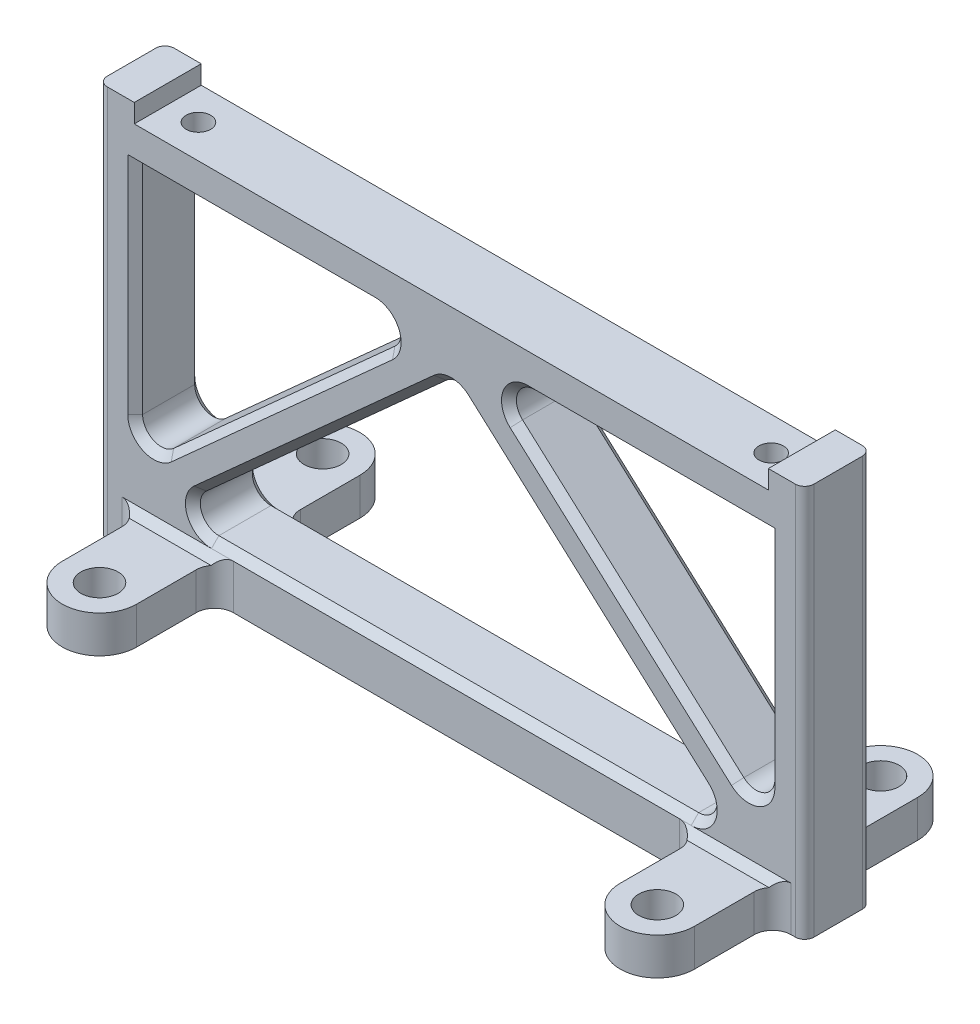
ISO-10303-21;
HEADER;
FILE_DESCRIPTION(('STEP AP214'),'2;1');
FILE_NAME('part.step','',(''),(''),'','','');
FILE_SCHEMA(('AUTOMOTIVE_DESIGN { 1 0 10303 214 1 1 1 1 }'));
ENDSEC;
DATA;
#1=APPLICATION_CONTEXT('core data for automotive mechanical design processes');
#2=APPLICATION_PROTOCOL_DEFINITION('international standard','automotive_design',2000,#1);
#3=PRODUCT_CONTEXT('',#1,'mechanical');
#4=PRODUCT('Part','Part','',(#3));
#5=PRODUCT_RELATED_PRODUCT_CATEGORY('part','',(#4));
#6=PRODUCT_DEFINITION_FORMATION('','',#4);
#7=PRODUCT_DEFINITION_CONTEXT('part definition',#1,'design');
#8=PRODUCT_DEFINITION('design','',#6,#7);
#9=PRODUCT_DEFINITION_SHAPE('','',#8);
#10=(LENGTH_UNIT() NAMED_UNIT(*) SI_UNIT(.MILLI.,.METRE.));
#11=(NAMED_UNIT(*) PLANE_ANGLE_UNIT() SI_UNIT($,.RADIAN.));
#12=(NAMED_UNIT(*) SI_UNIT($,.STERADIAN.) SOLID_ANGLE_UNIT());
#13=UNCERTAINTY_MEASURE_WITH_UNIT(LENGTH_MEASURE(1.E-05),#10,'distance_accuracy_value','');
#14=(GEOMETRIC_REPRESENTATION_CONTEXT(3) GLOBAL_UNCERTAINTY_ASSIGNED_CONTEXT((#13)) GLOBAL_UNIT_ASSIGNED_CONTEXT((#10,
#11,#12)) REPRESENTATION_CONTEXT('',''));
#15=CARTESIAN_POINT('',(0.,0.,0.));
#16=DIRECTION('',(0.,0.,1.));
#17=DIRECTION('',(1.,0.,0.));
#18=AXIS2_PLACEMENT_3D('',#15,#16,#17);
#19=CARTESIAN_POINT('',(0.,0.,18.));
#20=DIRECTION('',(0.,0.,-1.));
#21=DIRECTION('',(-1.,0.,0.));
#22=AXIS2_PLACEMENT_3D('',#19,#20,#21);
#23=PLANE('',#22);
#24=CARTESIAN_POINT('',(-80.,-68.5463759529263,18.));
#25=DIRECTION('',(0.,0.,-1.));
#26=DIRECTION('',(-1.,0.,0.));
#27=AXIS2_PLACEMENT_3D('',#24,#25,#26);
#28=CIRCLE('',#27,6.99999999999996);
#29=CARTESIAN_POINT('',(-75.3172468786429,-73.7494349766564,18.));
#30=VERTEX_POINT('',#29);
#31=CARTESIAN_POINT('',(-87.,-68.5463759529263,18.));
#32=VERTEX_POINT('',#31);
#33=EDGE_CURVE('E570',#30,#32,#28,.T.);
#34=ORIENTED_EDGE('',*,*,#33,.T.);
#35=DIRECTION('',(0.,1.,0.));
#36=VECTOR('',#35,1.);
#37=CARTESIAN_POINT('',(-87.,-10.,18.));
#38=LINE('',#37,#36);
#39=CARTESIAN_POINT('',(-87.,-8.00000000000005,18.));
#40=VERTEX_POINT('',#39);
#41=EDGE_CURVE('E12',#32,#40,#38,.T.);
#42=ORIENTED_EDGE('',*,*,#41,.T.);
#43=DIRECTION('',(1.,0.,0.));
#44=VECTOR('',#43,1.);
#45=CARTESIAN_POINT('',(-20.5040267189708,-8.00000000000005,18.));
#46=LINE('',#45,#44);
#47=CARTESIAN_POINT('',(-20.5040267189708,-8.00000000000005,18.));
#48=VERTEX_POINT('',#47);
#49=EDGE_CURVE('E52',#40,#48,#46,.T.);
#50=ORIENTED_EDGE('',*,*,#49,.T.);
#51=CARTESIAN_POINT('',(-20.5040267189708,-15.,18.));
#52=DIRECTION('',(0.,0.,-1.));
#53=DIRECTION('',(-1.,0.,0.));
#54=AXIS2_PLACEMENT_3D('',#51,#52,#53);
#55=CIRCLE('',#54,6.99999999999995);
#56=CARTESIAN_POINT('',(-15.8212735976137,-20.2030590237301,18.));
#57=VERTEX_POINT('',#56);
#58=EDGE_CURVE('E567',#48,#57,#55,.T.);
#59=ORIENTED_EDGE('',*,*,#58,.T.);
#60=DIRECTION('',(-0.743294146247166,-0.66896473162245,0.));
#61=VECTOR('',#60,1.);
#62=CARTESIAN_POINT('',(2.96548149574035,-3.2949794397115,18.));
#63=LINE('',#62,#61);
#64=EDGE_CURVE('E564',#57,#30,#63,.T.);
#65=ORIENTED_EDGE('',*,*,#64,.T.);
#66=EDGE_LOOP('',(#34,#42,#50,#59,#65));
#67=FACE_BOUND('',#66,.T.);
#68=CARTESIAN_POINT('',(20.5040267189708,-15.,18.));
#69=DIRECTION('',(0.,0.,-1.));
#70=DIRECTION('',(-1.,0.,0.));
#71=AXIS2_PLACEMENT_3D('',#68,#69,#70);
#72=CIRCLE('',#71,6.99999999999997);
#73=CARTESIAN_POINT('',(15.8212735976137,-20.2030590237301,18.));
#74=VERTEX_POINT('',#73);
#75=CARTESIAN_POINT('',(20.5040267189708,-8.00000000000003,18.));
#76=VERTEX_POINT('',#75);
#77=EDGE_CURVE('E555',#74,#76,#72,.T.);
#78=ORIENTED_EDGE('',*,*,#77,.T.);
#79=DIRECTION('',(1.,0.,0.));
#80=VECTOR('',#79,1.);
#81=CARTESIAN_POINT('',(85.,-8.00000000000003,18.));
#82=LINE('',#81,#80);
#83=CARTESIAN_POINT('',(87.,-8.00000000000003,18.));
#84=VERTEX_POINT('',#83);
#85=EDGE_CURVE('E561',#76,#84,#82,.T.);
#86=ORIENTED_EDGE('',*,*,#85,.T.);
#87=DIRECTION('',(0.,-1.,0.));
#88=VECTOR('',#87,1.);
#89=CARTESIAN_POINT('',(87.,-68.5463759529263,18.));
#90=LINE('',#89,#88);
#91=CARTESIAN_POINT('',(87.,-68.5463759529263,18.));
#92=VERTEX_POINT('',#91);
#93=EDGE_CURVE('E558',#84,#92,#90,.T.);
#94=ORIENTED_EDGE('',*,*,#93,.T.);
#95=CARTESIAN_POINT('',(80.,-68.5463759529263,18.));
#96=DIRECTION('',(0.,0.,-1.));
#97=DIRECTION('',(-1.,0.,0.));
#98=AXIS2_PLACEMENT_3D('',#95,#96,#97);
#99=CIRCLE('',#98,6.99999999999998);
#100=CARTESIAN_POINT('',(75.3172468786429,-73.7494349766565,18.));
#101=VERTEX_POINT('',#100);
#102=EDGE_CURVE('E552',#92,#101,#99,.T.);
#103=ORIENTED_EDGE('',*,*,#102,.T.);
#104=DIRECTION('',(-0.743294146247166,0.66896473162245,0.));
#105=VECTOR('',#104,1.);
#106=CARTESIAN_POINT('',(-2.96548149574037,-3.29497943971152,18.));
#107=LINE('',#106,#105);
#108=EDGE_CURVE('E549',#101,#74,#107,.T.);
#109=ORIENTED_EDGE('',*,*,#108,.T.);
#110=EDGE_LOOP('',(#78,#86,#94,#103,#109));
#111=FACE_BOUND('',#110,.T.);
#112=DIRECTION('',(1.,0.,0.));
#113=VECTOR('',#112,1.);
#114=CARTESIAN_POINT('',(-58.6,-88.499999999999,18.));
#115=LINE('',#114,#113);
#116=CARTESIAN_POINT('',(-88.6,-88.499999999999,18.));
#117=VERTEX_POINT('',#116);
#118=CARTESIAN_POINT('',(-64.4959732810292,-88.499999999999,18.));
#119=VERTEX_POINT('',#118);
#120=EDGE_CURVE('E341',#117,#119,#115,.T.);
#121=ORIENTED_EDGE('',*,*,#120,.T.);
#122=CARTESIAN_POINT('',(-64.4959732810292,-81.5,18.));
#123=DIRECTION('',(0.,0.,-1.));
#124=DIRECTION('',(-1.,0.,0.));
#125=AXIS2_PLACEMENT_3D('',#122,#123,#124);
#126=CIRCLE('',#125,7.00000000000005);
#127=CARTESIAN_POINT('',(-69.1787264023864,-76.2969409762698,18.));
#128=VERTEX_POINT('',#127);
#129=EDGE_CURVE('E546',#119,#128,#126,.T.);
#130=ORIENTED_EDGE('',*,*,#129,.T.);
#131=DIRECTION('',(0.743294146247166,0.66896473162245,0.));
#132=VECTOR('',#131,1.);
#133=CARTESIAN_POINT('',(-4.68275312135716,-18.2505650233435,18.));
#134=LINE('',#133,#132);
#135=CARTESIAN_POINT('',(-4.68275312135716,-18.2505650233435,18.));
#136=VERTEX_POINT('',#135);
#137=EDGE_CURVE('E543',#128,#136,#134,.T.);
#138=ORIENTED_EDGE('',*,*,#137,.T.);
#139=CARTESIAN_POINT('',(0.,-23.4536240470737,18.));
#140=DIRECTION('',(0.,0.,-1.));
#141=DIRECTION('',(-1.,0.,0.));
#142=AXIS2_PLACEMENT_3D('',#139,#140,#141);
#143=CIRCLE('',#142,7.00000000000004);
#144=CARTESIAN_POINT('',(4.68275312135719,-18.2505650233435,18.));
#145=VERTEX_POINT('',#144);
#146=EDGE_CURVE('E540',#136,#145,#143,.T.);
#147=ORIENTED_EDGE('',*,*,#146,.T.);
#148=DIRECTION('',(0.743294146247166,-0.66896473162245,0.));
#149=VECTOR('',#148,1.);
#150=CARTESIAN_POINT('',(69.1787264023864,-76.2969409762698,18.));
#151=LINE('',#150,#149);
#152=CARTESIAN_POINT('',(69.1787264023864,-76.2969409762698,18.));
#153=VERTEX_POINT('',#152);
#154=EDGE_CURVE('E537',#145,#153,#151,.T.);
#155=ORIENTED_EDGE('',*,*,#154,.T.);
#156=CARTESIAN_POINT('',(64.4959732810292,-81.5,18.));
#157=DIRECTION('',(0.,0.,-1.));
#158=DIRECTION('',(-1.,0.,0.));
#159=AXIS2_PLACEMENT_3D('',#156,#157,#158);
#160=CIRCLE('',#159,7.00000000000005);
#161=CARTESIAN_POINT('',(64.4959732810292,-88.5,18.));
#162=VERTEX_POINT('',#161);
#163=EDGE_CURVE('E534',#153,#162,#160,.T.);
#164=ORIENTED_EDGE('',*,*,#163,.T.);
#165=DIRECTION('',(1.,0.,0.));
#166=VECTOR('',#165,1.);
#167=CARTESIAN_POINT('',(91.4,-88.5,18.));
#168=LINE('',#167,#166);
#169=CARTESIAN_POINT('',(91.4,-88.5,18.));
#170=VERTEX_POINT('',#169);
#171=EDGE_CURVE('E336',#162,#170,#168,.T.);
#172=ORIENTED_EDGE('',*,*,#171,.T.);
#173=DIRECTION('',(0.,-1.,0.));
#174=VECTOR('',#173,1.);
#175=CARTESIAN_POINT('',(91.4,0.,18.));
#176=LINE('',#175,#174);
#177=CARTESIAN_POINT('',(91.4,-100.5,18.));
#178=VERTEX_POINT('',#177);
#179=EDGE_CURVE('E249',#170,#178,#176,.T.);
#180=ORIENTED_EDGE('',*,*,#179,.T.);
#181=DIRECTION('',(1.,0.,0.));
#182=VECTOR('',#181,1.);
#183=CARTESIAN_POINT('',(95.,-100.5,18.));
#184=LINE('',#183,#182);
#185=CARTESIAN_POINT('',(92.5,-100.5,18.));
#186=VERTEX_POINT('',#185);
#187=EDGE_CURVE('E138',#178,#186,#184,.T.);
#188=ORIENTED_EDGE('',*,*,#187,.T.);
#189=DIRECTION('',(0.,1.,0.));
#190=VECTOR('',#189,1.);
#191=CARTESIAN_POINT('',(92.5,0.,18.));
#192=LINE('',#191,#190);
#193=CARTESIAN_POINT('',(92.5,5.,18.));
#194=VERTEX_POINT('',#193);
#195=EDGE_CURVE('E223',#186,#194,#192,.T.);
#196=ORIENTED_EDGE('',*,*,#195,.T.);
#197=DIRECTION('',(-1.,0.,0.));
#198=VECTOR('',#197,1.);
#199=CARTESIAN_POINT('',(85.,5.,18.));
#200=LINE('',#199,#198);
#201=CARTESIAN_POINT('',(85.25,5.,18.));
#202=VERTEX_POINT('',#201);
#203=EDGE_CURVE('E99',#194,#202,#200,.T.);
#204=ORIENTED_EDGE('',*,*,#203,.T.);
#205=DIRECTION('',(0.,-1.,0.));
#206=VECTOR('',#205,1.);
#207=CARTESIAN_POINT('',(85.25,0.,18.));
#208=LINE('',#207,#206);
#209=CARTESIAN_POINT('',(85.25,0.,18.));
#210=VERTEX_POINT('',#209);
#211=EDGE_CURVE('E91',#202,#210,#208,.T.);
#212=ORIENTED_EDGE('',*,*,#211,.T.);
#213=DIRECTION('',(-1.,0.,0.));
#214=VECTOR('',#213,1.);
#215=CARTESIAN_POINT('',(-85.,0.,18.));
#216=LINE('',#215,#214);
#217=CARTESIAN_POINT('',(-85.25,0.,18.));
#218=VERTEX_POINT('',#217);
#219=EDGE_CURVE('E95',#210,#218,#216,.T.);
#220=ORIENTED_EDGE('',*,*,#219,.T.);
#221=DIRECTION('',(0.,1.,0.));
#222=VECTOR('',#221,1.);
#223=CARTESIAN_POINT('',(-85.25,0.,18.));
#224=LINE('',#223,#222);
#225=CARTESIAN_POINT('',(-85.25,4.99999999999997,18.));
#226=VERTEX_POINT('',#225);
#227=EDGE_CURVE('E115',#218,#226,#224,.T.);
#228=ORIENTED_EDGE('',*,*,#227,.T.);
#229=DIRECTION('',(-1.,0.,0.));
#230=VECTOR('',#229,1.);
#231=CARTESIAN_POINT('',(-85.,4.99999999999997,18.));
#232=LINE('',#231,#230);
#233=CARTESIAN_POINT('',(-92.5,4.99999999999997,18.));
#234=VERTEX_POINT('',#233);
#235=EDGE_CURVE('E117',#226,#234,#232,.T.);
#236=ORIENTED_EDGE('',*,*,#235,.T.);
#237=DIRECTION('',(0.,-1.,0.));
#238=VECTOR('',#237,1.);
#239=CARTESIAN_POINT('',(-92.5,0.,18.));
#240=LINE('',#239,#238);
#241=CARTESIAN_POINT('',(-92.5,-100.5,18.));
#242=VERTEX_POINT('',#241);
#243=EDGE_CURVE('E225',#234,#242,#240,.T.);
#244=ORIENTED_EDGE('',*,*,#243,.T.);
#245=CARTESIAN_POINT('',(-88.6,-100.5,18.));
#246=VERTEX_POINT('',#245);
#247=EDGE_CURVE('E708',#242,#246,#184,.T.);
#248=ORIENTED_EDGE('',*,*,#247,.T.);
#249=DIRECTION('',(0.,-1.,0.));
#250=VECTOR('',#249,1.);
#251=CARTESIAN_POINT('',(-88.6,0.,18.));
#252=LINE('',#251,#250);
#253=EDGE_CURVE('E240',#246,#117,#252,.F.);
#254=ORIENTED_EDGE('',*,*,#253,.T.);
#255=EDGE_LOOP('',(#121,#130,#138,#147,#155,#164,#172,#180,#188,#196,#204,#212,#220,#228,#236,
#244,#248,#254));
#256=FACE_BOUND('',#255,.T.);
#257=ADVANCED_FACE('F42',(#67,#111,#256),#23,.F.);
#258=CARTESIAN_POINT('',(0.,0.,0.));
#259=DIRECTION('',(0.,0.,-1.));
#260=DIRECTION('',(-1.,0.,0.));
#261=AXIS2_PLACEMENT_3D('',#258,#259,#260);
#262=PLANE('',#261);
#263=DIRECTION('',(-1.,0.,0.));
#264=VECTOR('',#263,1.);
#265=CARTESIAN_POINT('',(0.,-8.00000000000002,0.));
#266=LINE('',#265,#264);
#267=CARTESIAN_POINT('',(-20.5040267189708,-8.00000000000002,0.));
#268=VERTEX_POINT('',#267);
#269=CARTESIAN_POINT('',(-87.,-8.00000000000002,0.));
#270=VERTEX_POINT('',#269);
#271=EDGE_CURVE('E429',#268,#270,#266,.T.);
#272=ORIENTED_EDGE('',*,*,#271,.T.);
#273=DIRECTION('',(0.,-1.,0.));
#274=VECTOR('',#273,1.);
#275=CARTESIAN_POINT('',(-87.,0.,0.));
#276=LINE('',#275,#274);
#277=CARTESIAN_POINT('',(-87.,-68.5463759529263,0.));
#278=VERTEX_POINT('',#277);
#279=EDGE_CURVE('E432',#270,#278,#276,.T.);
#280=ORIENTED_EDGE('',*,*,#279,.T.);
#281=CARTESIAN_POINT('',(-80.,-68.5463759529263,0.));
#282=DIRECTION('',(0.,0.,-1.));
#283=DIRECTION('',(-1.,0.,0.));
#284=AXIS2_PLACEMENT_3D('',#281,#282,#283);
#285=CIRCLE('',#284,6.99999999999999);
#286=CARTESIAN_POINT('',(-75.3172468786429,-73.7494349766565,0.));
#287=VERTEX_POINT('',#286);
#288=EDGE_CURVE('E426',#278,#287,#285,.F.);
#289=ORIENTED_EDGE('',*,*,#288,.T.);
#290=DIRECTION('',(0.743294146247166,0.66896473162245,0.));
#291=VECTOR('',#290,1.);
#292=CARTESIAN_POINT('',(-15.8212735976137,-20.2030590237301,0.));
#293=LINE('',#292,#291);
#294=CARTESIAN_POINT('',(-15.8212735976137,-20.2030590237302,0.));
#295=VERTEX_POINT('',#294);
#296=EDGE_CURVE('E420',#287,#295,#293,.T.);
#297=ORIENTED_EDGE('',*,*,#296,.T.);
#298=CARTESIAN_POINT('',(-20.5040267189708,-15.,0.));
#299=DIRECTION('',(0.,0.,-1.));
#300=DIRECTION('',(-1.,0.,0.));
#301=AXIS2_PLACEMENT_3D('',#298,#299,#300);
#302=CIRCLE('',#301,6.99999999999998);
#303=EDGE_CURVE('E423',#295,#268,#302,.F.);
#304=ORIENTED_EDGE('',*,*,#303,.T.);
#305=EDGE_LOOP('',(#272,#280,#289,#297,#304));
#306=FACE_BOUND('',#305,.T.);
#307=DIRECTION('',(0.,1.,0.));
#308=VECTOR('',#307,1.);
#309=CARTESIAN_POINT('',(87.,0.,0.));
#310=LINE('',#309,#308);
#311=CARTESIAN_POINT('',(87.,-68.5463759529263,0.));
#312=VERTEX_POINT('',#311);
#313=CARTESIAN_POINT('',(87.,-8.00000000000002,0.));
#314=VERTEX_POINT('',#313);
#315=EDGE_CURVE('E414',#312,#314,#310,.T.);
#316=ORIENTED_EDGE('',*,*,#315,.T.);
#317=DIRECTION('',(-1.,0.,0.));
#318=VECTOR('',#317,1.);
#319=CARTESIAN_POINT('',(0.,-8.00000000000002,0.));
#320=LINE('',#319,#318);
#321=CARTESIAN_POINT('',(20.5040267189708,-8.00000000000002,0.));
#322=VERTEX_POINT('',#321);
#323=EDGE_CURVE('E417',#314,#322,#320,.T.);
#324=ORIENTED_EDGE('',*,*,#323,.T.);
#325=CARTESIAN_POINT('',(20.5040267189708,-15.,0.));
#326=DIRECTION('',(0.,0.,-1.));
#327=DIRECTION('',(-1.,0.,0.));
#328=AXIS2_PLACEMENT_3D('',#325,#326,#327);
#329=CIRCLE('',#328,6.99999999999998);
#330=CARTESIAN_POINT('',(15.8212735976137,-20.2030590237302,0.));
#331=VERTEX_POINT('',#330);
#332=EDGE_CURVE('E411',#322,#331,#329,.F.);
#333=ORIENTED_EDGE('',*,*,#332,.T.);
#334=DIRECTION('',(0.743294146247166,-0.66896473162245,0.));
#335=VECTOR('',#334,1.);
#336=CARTESIAN_POINT('',(75.3172468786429,-73.7494349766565,0.));
#337=LINE('',#336,#335);
#338=CARTESIAN_POINT('',(75.3172468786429,-73.7494349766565,0.));
#339=VERTEX_POINT('',#338);
#340=EDGE_CURVE('E405',#331,#339,#337,.T.);
#341=ORIENTED_EDGE('',*,*,#340,.T.);
#342=CARTESIAN_POINT('',(80.,-68.5463759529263,0.));
#343=DIRECTION('',(0.,0.,-1.));
#344=DIRECTION('',(-1.,0.,0.));
#345=AXIS2_PLACEMENT_3D('',#342,#343,#344);
#346=CIRCLE('',#345,6.99999999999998);
#347=EDGE_CURVE('E408',#339,#312,#346,.F.);
#348=ORIENTED_EDGE('',*,*,#347,.T.);
#349=EDGE_LOOP('',(#316,#324,#333,#341,#348));
#350=FACE_BOUND('',#349,.T.);
#351=DIRECTION('',(-0.743294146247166,-0.66896473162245,0.));
#352=VECTOR('',#351,1.);
#353=CARTESIAN_POINT('',(6.97926988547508,-7.75474431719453,0.));
#354=LINE('',#353,#352);
#355=CARTESIAN_POINT('',(-4.68275312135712,-18.2505650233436,0.));
#356=VERTEX_POINT('',#355);
#357=CARTESIAN_POINT('',(-69.1787264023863,-76.2969409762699,0.));
#358=VERTEX_POINT('',#357);
#359=EDGE_CURVE('E399',#356,#358,#354,.T.);
#360=ORIENTED_EDGE('',*,*,#359,.T.);
#361=CARTESIAN_POINT('',(-64.4959732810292,-81.5,0.));
#362=DIRECTION('',(0.,0.,-1.));
#363=DIRECTION('',(-1.,0.,0.));
#364=AXIS2_PLACEMENT_3D('',#361,#362,#363);
#365=CIRCLE('',#364,6.99999999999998);
#366=CARTESIAN_POINT('',(-64.4959732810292,-88.4999999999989,0.));
#367=VERTEX_POINT('',#366);
#368=EDGE_CURVE('E402',#358,#367,#365,.F.);
#369=ORIENTED_EDGE('',*,*,#368,.T.);
#370=DIRECTION('',(-1.,0.,0.));
#371=VECTOR('',#370,1.);
#372=CARTESIAN_POINT('',(-88.6,-88.4999999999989,0.));
#373=LINE('',#372,#371);
#374=CARTESIAN_POINT('',(-88.6,-88.4999999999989,0.));
#375=VERTEX_POINT('',#374);
#376=EDGE_CURVE('E350',#367,#375,#373,.T.);
#377=ORIENTED_EDGE('',*,*,#376,.T.);
#378=DIRECTION('',(0.,-1.,0.));
#379=VECTOR('',#378,1.);
#380=CARTESIAN_POINT('',(-88.6,-100.5,0.));
#381=LINE('',#380,#379);
#382=CARTESIAN_POINT('',(-88.6,-100.5,0.));
#383=VERTEX_POINT('',#382);
#384=EDGE_CURVE('E261',#375,#383,#381,.T.);
#385=ORIENTED_EDGE('',*,*,#384,.T.);
#386=DIRECTION('',(1.,0.,0.));
#387=VECTOR('',#386,1.);
#388=CARTESIAN_POINT('',(95.,-100.5,0.));
#389=LINE('',#388,#387);
#390=CARTESIAN_POINT('',(-92.5,-100.5,0.));
#391=VERTEX_POINT('',#390);
#392=EDGE_CURVE('E125',#391,#383,#389,.T.);
#393=ORIENTED_EDGE('',*,*,#392,.F.);
#394=DIRECTION('',(0.,-1.,0.));
#395=VECTOR('',#394,1.);
#396=CARTESIAN_POINT('',(-92.5,4.99999999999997,0.));
#397=LINE('',#396,#395);
#398=CARTESIAN_POINT('',(-92.5,4.99999999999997,0.));
#399=VERTEX_POINT('',#398);
#400=EDGE_CURVE('E214',#391,#399,#397,.F.);
#401=ORIENTED_EDGE('',*,*,#400,.T.);
#402=DIRECTION('',(-1.,0.,0.));
#403=VECTOR('',#402,1.);
#404=CARTESIAN_POINT('',(-85.,4.99999999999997,0.));
#405=LINE('',#404,#403);
#406=CARTESIAN_POINT('',(-85.25,4.99999999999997,0.));
#407=VERTEX_POINT('',#406);
#408=EDGE_CURVE('E135',#407,#399,#405,.T.);
#409=ORIENTED_EDGE('',*,*,#408,.F.);
#410=DIRECTION('',(0.,1.,0.));
#411=VECTOR('',#410,1.);
#412=CARTESIAN_POINT('',(-85.25,0.,0.));
#413=LINE('',#412,#411);
#414=CARTESIAN_POINT('',(-85.25,0.,0.));
#415=VERTEX_POINT('',#414);
#416=EDGE_CURVE('E134',#415,#407,#413,.T.);
#417=ORIENTED_EDGE('',*,*,#416,.F.);
#418=DIRECTION('',(-1.,0.,0.));
#419=VECTOR('',#418,1.);
#420=CARTESIAN_POINT('',(-85.,0.,0.));
#421=LINE('',#420,#419);
#422=CARTESIAN_POINT('',(85.25,0.,0.));
#423=VERTEX_POINT('',#422);
#424=EDGE_CURVE('E132',#423,#415,#421,.T.);
#425=ORIENTED_EDGE('',*,*,#424,.F.);
#426=DIRECTION('',(0.,-1.,0.));
#427=VECTOR('',#426,1.);
#428=CARTESIAN_POINT('',(85.25,0.,0.));
#429=LINE('',#428,#427);
#430=CARTESIAN_POINT('',(85.25,5.,0.));
#431=VERTEX_POINT('',#430);
#432=EDGE_CURVE('E106',#431,#423,#429,.T.);
#433=ORIENTED_EDGE('',*,*,#432,.F.);
#434=DIRECTION('',(-1.,0.,0.));
#435=VECTOR('',#434,1.);
#436=CARTESIAN_POINT('',(85.,5.,0.));
#437=LINE('',#436,#435);
#438=CARTESIAN_POINT('',(92.5,5.,0.));
#439=VERTEX_POINT('',#438);
#440=EDGE_CURVE('E128',#439,#431,#437,.T.);
#441=ORIENTED_EDGE('',*,*,#440,.F.);
#442=DIRECTION('',(0.,1.,0.));
#443=VECTOR('',#442,1.);
#444=CARTESIAN_POINT('',(92.5,-100.5,0.));
#445=LINE('',#444,#443);
#446=CARTESIAN_POINT('',(92.5,-100.5,0.));
#447=VERTEX_POINT('',#446);
#448=EDGE_CURVE('E211',#439,#447,#445,.F.);
#449=ORIENTED_EDGE('',*,*,#448,.T.);
#450=CARTESIAN_POINT('',(91.4,-100.5,0.));
#451=VERTEX_POINT('',#450);
#452=EDGE_CURVE('E130',#451,#447,#389,.T.);
#453=ORIENTED_EDGE('',*,*,#452,.F.);
#454=DIRECTION('',(0.,-1.,0.));
#455=VECTOR('',#454,1.);
#456=CARTESIAN_POINT('',(91.4,-90.5,0.));
#457=LINE('',#456,#455);
#458=CARTESIAN_POINT('',(91.4,-88.5,0.));
#459=VERTEX_POINT('',#458);
#460=EDGE_CURVE('E267',#451,#459,#457,.F.);
#461=ORIENTED_EDGE('',*,*,#460,.T.);
#462=DIRECTION('',(-1.,0.,0.));
#463=VECTOR('',#462,1.);
#464=CARTESIAN_POINT('',(61.4,-88.5,0.));
#465=LINE('',#464,#463);
#466=CARTESIAN_POINT('',(64.4959732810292,-88.5,0.));
#467=VERTEX_POINT('',#466);
#468=EDGE_CURVE('E347',#459,#467,#465,.T.);
#469=ORIENTED_EDGE('',*,*,#468,.T.);
#470=CARTESIAN_POINT('',(64.4959732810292,-81.5,0.));
#471=DIRECTION('',(0.,0.,-1.));
#472=DIRECTION('',(-1.,0.,0.));
#473=AXIS2_PLACEMENT_3D('',#470,#471,#472);
#474=CIRCLE('',#473,6.99999999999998);
#475=CARTESIAN_POINT('',(69.1787264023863,-76.2969409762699,0.));
#476=VERTEX_POINT('',#475);
#477=EDGE_CURVE('E390',#467,#476,#474,.F.);
#478=ORIENTED_EDGE('',*,*,#477,.T.);
#479=DIRECTION('',(-0.743294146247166,0.66896473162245,0.));
#480=VECTOR('',#479,1.);
#481=CARTESIAN_POINT('',(-6.9792698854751,-7.75474431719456,0.));
#482=LINE('',#481,#480);
#483=CARTESIAN_POINT('',(4.68275312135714,-18.2505650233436,0.));
#484=VERTEX_POINT('',#483);
#485=EDGE_CURVE('E393',#476,#484,#482,.T.);
#486=ORIENTED_EDGE('',*,*,#485,.T.);
#487=CARTESIAN_POINT('',(0.,-23.4536240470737,0.));
#488=DIRECTION('',(0.,0.,-1.));
#489=DIRECTION('',(-1.,0.,0.));
#490=AXIS2_PLACEMENT_3D('',#487,#488,#489);
#491=CIRCLE('',#490,6.99999999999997);
#492=EDGE_CURVE('E396',#484,#356,#491,.F.);
#493=ORIENTED_EDGE('',*,*,#492,.T.);
#494=EDGE_LOOP('',(#360,#369,#377,#385,#393,#401,#409,#417,#425,#433,#441,#449,#453,#461,#469,
#478,#486,#493));
#495=FACE_BOUND('',#494,.T.);
#496=ADVANCED_FACE('F677',(#306,#350,#495),#262,.T.);
#497=DIRECTION('',(0.,-1.,0.));
#498=VECTOR('',#497,1.);
#499=CARTESIAN_POINT('',(61.4,0.,18.));
#500=LINE('',#499,#498);
#501=CARTESIAN_POINT('',(61.4,-100.5,18.));
#502=VERTEX_POINT('',#501);
#503=CARTESIAN_POINT('',(61.4,-88.5,18.));
#504=VERTEX_POINT('',#503);
#505=EDGE_CURVE('E246',#502,#504,#500,.F.);
#506=ORIENTED_EDGE('',*,*,#505,.T.);
#507=DIRECTION('',(-1.,0.,0.));
#508=VECTOR('',#507,1.);
#509=CARTESIAN_POINT('',(-64.4959732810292,-88.5000000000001,18.));
#510=LINE('',#509,#508);
#511=CARTESIAN_POINT('',(-58.6,-88.499999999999,18.));
#512=VERTEX_POINT('',#511);
#513=EDGE_CURVE('E531',#504,#512,#510,.T.);
#514=ORIENTED_EDGE('',*,*,#513,.T.);
#515=DIRECTION('',(0.,-1.,0.));
#516=VECTOR('',#515,1.);
#517=CARTESIAN_POINT('',(-58.6,0.,18.));
#518=LINE('',#517,#516);
#519=CARTESIAN_POINT('',(-58.6,-100.5,18.));
#520=VERTEX_POINT('',#519);
#521=EDGE_CURVE('E243',#512,#520,#518,.T.);
#522=ORIENTED_EDGE('',*,*,#521,.T.);
#523=EDGE_CURVE('E988',#520,#502,#184,.T.);
#524=ORIENTED_EDGE('',*,*,#523,.T.);
#525=EDGE_LOOP('',(#506,#514,#522,#524));
#526=FACE_BOUND('',#525,.T.);
#527=ADVANCED_FACE('F1131',(#526),#23,.F.);
#528=CARTESIAN_POINT('',(-85.,-10.,18.));
#529=DIRECTION('',(1.,0.,0.));
#530=DIRECTION('',(0.,1.,0.));
#531=AXIS2_PLACEMENT_3D('',#528,#529,#530);
#532=PLANE('',#531);
#533=DIRECTION('',(0.,0.,-1.));
#534=VECTOR('',#533,1.);
#535=CARTESIAN_POINT('',(-85.,-68.5463759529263,18.));
#536=LINE('',#535,#534);
#537=CARTESIAN_POINT('',(-85.,-68.5463759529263,16.0000000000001));
#538=VERTEX_POINT('',#537);
#539=CARTESIAN_POINT('',(-85.,-68.5463759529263,2.));
#540=VERTEX_POINT('',#539);
#541=EDGE_CURVE('E151',#538,#540,#536,.T.);
#542=ORIENTED_EDGE('',*,*,#541,.T.);
#543=DIRECTION('',(0.,1.,0.));
#544=VECTOR('',#543,1.);
#545=CARTESIAN_POINT('',(-85.,-10.,2.));
#546=LINE('',#545,#544);
#547=CARTESIAN_POINT('',(-85.,-10.,2.));
#548=VERTEX_POINT('',#547);
#549=EDGE_CURVE('E438',#540,#548,#546,.T.);
#550=ORIENTED_EDGE('',*,*,#549,.T.);
#551=DIRECTION('',(0.,0.,-1.));
#552=VECTOR('',#551,1.);
#553=CARTESIAN_POINT('',(-85.,-10.,18.));
#554=LINE('',#553,#552);
#555=CARTESIAN_POINT('',(-85.,-10.,16.0000000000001));
#556=VERTEX_POINT('',#555);
#557=EDGE_CURVE('E973',#556,#548,#554,.T.);
#558=ORIENTED_EDGE('',*,*,#557,.F.);
#559=DIRECTION('',(0.,-1.,0.));
#560=VECTOR('',#559,1.);
#561=CARTESIAN_POINT('',(-85.,-68.5463759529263,16.0000000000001));
#562=LINE('',#561,#560);
#563=EDGE_CURVE('E435',#556,#538,#562,.T.);
#564=ORIENTED_EDGE('',*,*,#563,.T.);
#565=EDGE_LOOP('',(#542,#550,#558,#564));
#566=FACE_BOUND('',#565,.T.);
#567=ADVANCED_FACE('F976',(#566),#532,.T.);
#568=CARTESIAN_POINT('',(85.,-10.,18.));
#569=DIRECTION('',(-1.,0.,0.));
#570=DIRECTION('',(0.,-1.,0.));
#571=AXIS2_PLACEMENT_3D('',#568,#569,#570);
#572=PLANE('',#571);
#573=DIRECTION('',(0.,0.,-1.));
#574=VECTOR('',#573,1.);
#575=CARTESIAN_POINT('',(85.,-10.,18.));
#576=LINE('',#575,#574);
#577=CARTESIAN_POINT('',(85.,-10.,16.));
#578=VERTEX_POINT('',#577);
#579=CARTESIAN_POINT('',(85.,-10.,1.99999999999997));
#580=VERTEX_POINT('',#579);
#581=EDGE_CURVE('E979',#578,#580,#576,.T.);
#582=ORIENTED_EDGE('',*,*,#581,.T.);
#583=DIRECTION('',(0.,-1.,0.));
#584=VECTOR('',#583,1.);
#585=CARTESIAN_POINT('',(85.,-10.,1.99999999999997));
#586=LINE('',#585,#584);
#587=CARTESIAN_POINT('',(85.,-68.5463759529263,1.99999999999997));
#588=VERTEX_POINT('',#587);
#589=EDGE_CURVE('E474',#580,#588,#586,.T.);
#590=ORIENTED_EDGE('',*,*,#589,.T.);
#591=DIRECTION('',(0.,0.,1.));
#592=VECTOR('',#591,1.);
#593=CARTESIAN_POINT('',(85.,-68.5463759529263,18.));
#594=LINE('',#593,#592);
#595=CARTESIAN_POINT('',(85.,-68.5463759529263,16.));
#596=VERTEX_POINT('',#595);
#597=EDGE_CURVE('E190',#588,#596,#594,.T.);
#598=ORIENTED_EDGE('',*,*,#597,.T.);
#599=DIRECTION('',(0.,1.,0.));
#600=VECTOR('',#599,1.);
#601=CARTESIAN_POINT('',(85.,-10.,16.));
#602=LINE('',#601,#600);
#603=EDGE_CURVE('E471',#596,#578,#602,.T.);
#604=ORIENTED_EDGE('',*,*,#603,.T.);
#605=EDGE_LOOP('',(#582,#590,#598,#604));
#606=FACE_BOUND('',#605,.T.);
#607=ADVANCED_FACE('F1142',(#606),#572,.T.);
#608=CARTESIAN_POINT('',(-85.,-10.,18.));
#609=DIRECTION('',(0.,-1.,0.));
#610=DIRECTION('',(0.,0.,-1.));
#611=AXIS2_PLACEMENT_3D('',#608,#609,#610);
#612=PLANE('',#611);
#613=CARTESIAN_POINT('',(-77.,-10.,9.));
#614=DIRECTION('',(0.,-1.,0.));
#615=DIRECTION('',(0.,0.,-1.));
#616=AXIS2_PLACEMENT_3D('',#613,#614,#615);
#617=CIRCLE('',#616,3.29999999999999);
#618=CARTESIAN_POINT('',(-77.,-10.,5.70000000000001));
#619=VERTEX_POINT('',#618);
#620=EDGE_CURVE('E1109',#619,#619,#617,.T.);
#621=ORIENTED_EDGE('',*,*,#620,.F.);
#622=EDGE_LOOP('',(#621));
#623=FACE_BOUND('',#622,.T.);
#624=ORIENTED_EDGE('',*,*,#557,.T.);
#625=DIRECTION('',(1.,0.,0.));
#626=VECTOR('',#625,1.);
#627=CARTESIAN_POINT('',(-85.,-10.,2.));
#628=LINE('',#627,#626);
#629=CARTESIAN_POINT('',(-20.5040267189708,-10.,2.00000000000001));
#630=VERTEX_POINT('',#629);
#631=EDGE_CURVE('E444',#548,#630,#628,.T.);
#632=ORIENTED_EDGE('',*,*,#631,.T.);
#633=DIRECTION('',(0.,0.,1.));
#634=VECTOR('',#633,1.);
#635=CARTESIAN_POINT('',(-20.5040267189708,-10.,18.));
#636=LINE('',#635,#634);
#637=CARTESIAN_POINT('',(-20.5040267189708,-10.,16.0000000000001));
#638=VERTEX_POINT('',#637);
#639=EDGE_CURVE('E187',#630,#638,#636,.T.);
#640=ORIENTED_EDGE('',*,*,#639,.T.);
#641=DIRECTION('',(-1.,0.,0.));
#642=VECTOR('',#641,1.);
#643=CARTESIAN_POINT('',(-85.,-10.,16.0000000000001));
#644=LINE('',#643,#642);
#645=EDGE_CURVE('E441',#638,#556,#644,.T.);
#646=ORIENTED_EDGE('',*,*,#645,.T.);
#647=EDGE_LOOP('',(#624,#632,#640,#646));
#648=FACE_BOUND('',#647,.T.);
#649=ADVANCED_FACE('F972',(#623,#648),#612,.T.);
#650=CARTESIAN_POINT('',(77.,-10.,9.));
#651=DIRECTION('',(0.,-1.,0.));
#652=DIRECTION('',(0.,0.,-1.));
#653=AXIS2_PLACEMENT_3D('',#650,#651,#652);
#654=CIRCLE('',#653,3.29999999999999);
#655=CARTESIAN_POINT('',(77.,-10.,5.70000000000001));
#656=VERTEX_POINT('',#655);
#657=EDGE_CURVE('E980',#656,#656,#654,.T.);
#658=ORIENTED_EDGE('',*,*,#657,.F.);
#659=EDGE_LOOP('',(#658));
#660=FACE_BOUND('',#659,.T.);
#661=DIRECTION('',(0.,0.,-1.));
#662=VECTOR('',#661,1.);
#663=CARTESIAN_POINT('',(20.5040267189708,-10.,18.));
#664=LINE('',#663,#662);
#665=CARTESIAN_POINT('',(20.5040267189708,-10.,16.));
#666=VERTEX_POINT('',#665);
#667=CARTESIAN_POINT('',(20.5040267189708,-10.,1.99999999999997));
#668=VERTEX_POINT('',#667);
#669=EDGE_CURVE('E178',#666,#668,#664,.T.);
#670=ORIENTED_EDGE('',*,*,#669,.T.);
#671=DIRECTION('',(1.,0.,0.));
#672=VECTOR('',#671,1.);
#673=CARTESIAN_POINT('',(-85.,-10.,1.99999999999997));
#674=LINE('',#673,#672);
#675=EDGE_CURVE('E468',#668,#580,#674,.T.);
#676=ORIENTED_EDGE('',*,*,#675,.T.);
#677=ORIENTED_EDGE('',*,*,#581,.F.);
#678=DIRECTION('',(-1.,0.,0.));
#679=VECTOR('',#678,1.);
#680=CARTESIAN_POINT('',(20.5040267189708,-10.,16.));
#681=LINE('',#680,#679);
#682=EDGE_CURVE('E465',#578,#666,#681,.T.);
#683=ORIENTED_EDGE('',*,*,#682,.T.);
#684=EDGE_LOOP('',(#670,#676,#677,#683));
#685=FACE_BOUND('',#684,.T.);
#686=ADVANCED_FACE('F1118',(#660,#685),#612,.T.);
#687=CARTESIAN_POINT('',(-85.,0.,18.));
#688=DIRECTION('',(0.,-1.,0.));
#689=DIRECTION('',(1.,0.,0.));
#690=AXIS2_PLACEMENT_3D('',#687,#688,#689);
#691=PLANE('',#690);
#692=CARTESIAN_POINT('',(77.,0.,9.));
#693=DIRECTION('',(0.,1.,0.));
#694=DIRECTION('',(0.,0.,1.));
#695=AXIS2_PLACEMENT_3D('',#692,#693,#694);
#696=CIRCLE('',#695,3.29999999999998);
#697=CARTESIAN_POINT('',(77.,0.,12.3));
#698=VERTEX_POINT('',#697);
#699=EDGE_CURVE('E985',#698,#698,#696,.T.);
#700=ORIENTED_EDGE('',*,*,#699,.F.);
#701=EDGE_LOOP('',(#700));
#702=FACE_BOUND('',#701,.T.);
#703=ORIENTED_EDGE('',*,*,#424,.T.);
#704=DIRECTION('',(0.,0.,-1.));
#705=VECTOR('',#704,1.);
#706=CARTESIAN_POINT('',(-85.25,0.,18.));
#707=LINE('',#706,#705);
#708=EDGE_CURVE('E110',#218,#415,#707,.T.);
#709=ORIENTED_EDGE('',*,*,#708,.F.);
#710=ORIENTED_EDGE('',*,*,#219,.F.);
#711=DIRECTION('',(0.,0.,-1.));
#712=VECTOR('',#711,1.);
#713=CARTESIAN_POINT('',(85.25,0.,18.));
#714=LINE('',#713,#712);
#715=EDGE_CURVE('E46',#210,#423,#714,.T.);
#716=ORIENTED_EDGE('',*,*,#715,.T.);
#717=EDGE_LOOP('',(#703,#709,#710,#716));
#718=FACE_BOUND('',#717,.T.);
#719=CARTESIAN_POINT('',(-77.,0.,9.));
#720=DIRECTION('',(0.,1.,0.));
#721=DIRECTION('',(0.,0.,1.));
#722=AXIS2_PLACEMENT_3D('',#719,#720,#721);
#723=CIRCLE('',#722,3.29999999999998);
#724=CARTESIAN_POINT('',(-77.,0.,12.3));
#725=VERTEX_POINT('',#724);
#726=EDGE_CURVE('E1105',#725,#725,#723,.T.);
#727=ORIENTED_EDGE('',*,*,#726,.F.);
#728=EDGE_LOOP('',(#727));
#729=FACE_BOUND('',#728,.T.);
#730=ADVANCED_FACE('F111',(#702,#718,#729),#691,.F.);
#731=DIRECTION('',(0.,-1.,0.));
#732=VECTOR('',#731,1.);
#733=CARTESIAN_POINT('',(-58.6,-90.5,0.));
#734=LINE('',#733,#732);
#735=CARTESIAN_POINT('',(-58.6,-100.5,0.));
#736=VERTEX_POINT('',#735);
#737=CARTESIAN_POINT('',(-58.6,-88.4999999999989,0.));
#738=VERTEX_POINT('',#737);
#739=EDGE_CURVE('E258',#736,#738,#734,.F.);
#740=ORIENTED_EDGE('',*,*,#739,.T.);
#741=DIRECTION('',(1.,0.,0.));
#742=VECTOR('',#741,1.);
#743=CARTESIAN_POINT('',(0.,-88.5,0.));
#744=LINE('',#743,#742);
#745=CARTESIAN_POINT('',(61.4,-88.5,0.));
#746=VERTEX_POINT('',#745);
#747=EDGE_CURVE('E387',#738,#746,#744,.T.);
#748=ORIENTED_EDGE('',*,*,#747,.T.);
#749=DIRECTION('',(0.,-1.,0.));
#750=VECTOR('',#749,1.);
#751=CARTESIAN_POINT('',(61.4,-100.5,0.));
#752=LINE('',#751,#750);
#753=CARTESIAN_POINT('',(61.4,-100.5,0.));
#754=VERTEX_POINT('',#753);
#755=EDGE_CURVE('E264',#746,#754,#752,.T.);
#756=ORIENTED_EDGE('',*,*,#755,.T.);
#757=EDGE_CURVE('E129',#736,#754,#389,.T.);
#758=ORIENTED_EDGE('',*,*,#757,.F.);
#759=EDGE_LOOP('',(#740,#748,#756,#758));
#760=FACE_BOUND('',#759,.T.);
#761=ADVANCED_FACE('F1060',(#760),#262,.T.);
#762=CARTESIAN_POINT('',(-95.,4.99999999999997,18.));
#763=DIRECTION('',(1.,0.,0.));
#764=DIRECTION('',(0.,1.,0.));
#765=AXIS2_PLACEMENT_3D('',#762,#763,#764);
#766=PLANE('',#765);
#767=DIRECTION('',(0.,0.,-1.));
#768=VECTOR('',#767,1.);
#769=CARTESIAN_POINT('',(-95.,4.99999999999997,18.));
#770=LINE('',#769,#768);
#771=CARTESIAN_POINT('',(-95.,4.99999999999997,15.5));
#772=VERTEX_POINT('',#771);
#773=CARTESIAN_POINT('',(-95.,4.99999999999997,2.5));
#774=VERTEX_POINT('',#773);
#775=EDGE_CURVE('E124',#772,#774,#770,.T.);
#776=ORIENTED_EDGE('',*,*,#775,.T.);
#777=DIRECTION('',(0.,-1.,0.));
#778=VECTOR('',#777,1.);
#779=CARTESIAN_POINT('',(-95.,-100.5,2.5));
#780=LINE('',#779,#778);
#781=CARTESIAN_POINT('',(-95.,-100.5,2.5));
#782=VERTEX_POINT('',#781);
#783=EDGE_CURVE('E196',#774,#782,#780,.T.);
#784=ORIENTED_EDGE('',*,*,#783,.T.);
#785=DIRECTION('',(0.,0.,-1.));
#786=VECTOR('',#785,1.);
#787=CARTESIAN_POINT('',(-95.,-100.5,18.));
#788=LINE('',#787,#786);
#789=CARTESIAN_POINT('',(-95.,-100.5,15.5));
#790=VERTEX_POINT('',#789);
#791=EDGE_CURVE('E148',#790,#782,#788,.T.);
#792=ORIENTED_EDGE('',*,*,#791,.F.);
#793=DIRECTION('',(0.,-1.,0.));
#794=VECTOR('',#793,1.);
#795=CARTESIAN_POINT('',(-95.,4.99999999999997,15.5));
#796=LINE('',#795,#794);
#797=EDGE_CURVE('E193',#790,#772,#796,.F.);
#798=ORIENTED_EDGE('',*,*,#797,.T.);
#799=EDGE_LOOP('',(#776,#784,#792,#798));
#800=FACE_BOUND('',#799,.T.);
#801=ADVANCED_FACE('F711',(#800),#766,.F.);
#802=CARTESIAN_POINT('',(95.,-100.5,18.));
#803=DIRECTION('',(0.,1.,0.));
#804=DIRECTION('',(-1.,0.,0.));
#805=AXIS2_PLACEMENT_3D('',#802,#803,#804);
#806=PLANE('',#805);
#807=ORIENTED_EDGE('',*,*,#791,.T.);
#808=CARTESIAN_POINT('',(-92.5,-100.5,2.5));
#809=DIRECTION('',(0.,1.,0.));
#810=DIRECTION('',(-1.,0.,0.));
#811=AXIS2_PLACEMENT_3D('',#808,#809,#810);
#812=CIRCLE('',#811,2.5);
#813=EDGE_CURVE('E208',#782,#391,#812,.F.);
#814=ORIENTED_EDGE('',*,*,#813,.T.);
#815=ORIENTED_EDGE('',*,*,#392,.T.);
#816=CARTESIAN_POINT('',(-88.6,-100.5,-5.));
#817=DIRECTION('',(0.,1.,0.));
#818=DIRECTION('',(-1.,0.,0.));
#819=AXIS2_PLACEMENT_3D('',#816,#817,#818);
#820=CIRCLE('',#819,5.);
#821=CARTESIAN_POINT('',(-83.6,-100.5,-4.99999999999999));
#822=VERTEX_POINT('',#821);
#823=EDGE_CURVE('E324',#383,#822,#820,.T.);
#824=ORIENTED_EDGE('',*,*,#823,.T.);
#825=DIRECTION('',(0.,0.,-1.));
#826=VECTOR('',#825,1.);
#827=CARTESIAN_POINT('',(-83.6,-100.5,-1.04989369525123E-12));
#828=LINE('',#827,#826);
#829=CARTESIAN_POINT('',(-83.6,-100.5,-21.0000000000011));
#830=VERTEX_POINT('',#829);
#831=EDGE_CURVE('E1244',#822,#830,#828,.T.);
#832=ORIENTED_EDGE('',*,*,#831,.T.);
#833=CARTESIAN_POINT('',(-73.6,-100.5,-21.000000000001));
#834=DIRECTION('',(0.,-1.,0.));
#835=DIRECTION('',(-1.,0.,0.));
#836=AXIS2_PLACEMENT_3D('',#833,#834,#835);
#837=CIRCLE('',#836,9.99999999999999);
#838=CARTESIAN_POINT('',(-63.6,-100.5,-21.000000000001));
#839=VERTEX_POINT('',#838);
#840=EDGE_CURVE('E1235',#830,#839,#837,.T.);
#841=ORIENTED_EDGE('',*,*,#840,.T.);
#842=DIRECTION('',(0.,0.,1.));
#843=VECTOR('',#842,1.);
#844=CARTESIAN_POINT('',(-63.6,-100.5,-1.04744440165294E-12));
#845=LINE('',#844,#843);
#846=CARTESIAN_POINT('',(-63.6,-100.5,-4.99999999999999));
#847=VERTEX_POINT('',#846);
#848=EDGE_CURVE('E1228',#839,#847,#845,.T.);
#849=ORIENTED_EDGE('',*,*,#848,.T.);
#850=CARTESIAN_POINT('',(-58.6,-100.5,-5.));
#851=DIRECTION('',(0.,1.,0.));
#852=DIRECTION('',(-1.,0.,0.));
#853=AXIS2_PLACEMENT_3D('',#850,#851,#852);
#854=CIRCLE('',#853,5.);
#855=EDGE_CURVE('E330',#847,#736,#854,.T.);
#856=ORIENTED_EDGE('',*,*,#855,.T.);
#857=ORIENTED_EDGE('',*,*,#757,.T.);
#858=CARTESIAN_POINT('',(61.4,-100.5,-5.));
#859=DIRECTION('',(0.,1.,0.));
#860=DIRECTION('',(-1.,0.,0.));
#861=AXIS2_PLACEMENT_3D('',#858,#859,#860);
#862=CIRCLE('',#861,5.);
#863=CARTESIAN_POINT('',(66.4,-100.5,-4.99999999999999));
#864=VERTEX_POINT('',#863);
#865=EDGE_CURVE('E306',#754,#864,#862,.T.);
#866=ORIENTED_EDGE('',*,*,#865,.T.);
#867=DIRECTION('',(0.,0.,-1.));
#868=VECTOR('',#867,1.);
#869=CARTESIAN_POINT('',(66.4,-100.5,0.));
#870=LINE('',#869,#868);
#871=CARTESIAN_POINT('',(66.4,-100.5,-21.));
#872=VERTEX_POINT('',#871);
#873=EDGE_CURVE('E1083',#864,#872,#870,.T.);
#874=ORIENTED_EDGE('',*,*,#873,.T.);
#875=CARTESIAN_POINT('',(76.4,-100.5,-21.));
#876=DIRECTION('',(0.,-1.,0.));
#877=DIRECTION('',(-1.,0.,0.));
#878=AXIS2_PLACEMENT_3D('',#875,#876,#877);
#879=CIRCLE('',#878,9.99999999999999);
#880=CARTESIAN_POINT('',(86.4,-100.5,-21.));
#881=VERTEX_POINT('',#880);
#882=EDGE_CURVE('E1088',#872,#881,#879,.T.);
#883=ORIENTED_EDGE('',*,*,#882,.T.);
#884=DIRECTION('',(0.,0.,1.));
#885=VECTOR('',#884,1.);
#886=CARTESIAN_POINT('',(86.4,-100.5,0.));
#887=LINE('',#886,#885);
#888=CARTESIAN_POINT('',(86.4,-100.5,-4.99999999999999));
#889=VERTEX_POINT('',#888);
#890=EDGE_CURVE('E1091',#881,#889,#887,.T.);
#891=ORIENTED_EDGE('',*,*,#890,.T.);
#892=CARTESIAN_POINT('',(91.4,-100.5,-5.));
#893=DIRECTION('',(0.,1.,0.));
#894=DIRECTION('',(-1.,0.,0.));
#895=AXIS2_PLACEMENT_3D('',#892,#893,#894);
#896=CIRCLE('',#895,5.);
#897=EDGE_CURVE('E294',#889,#451,#896,.T.);
#898=ORIENTED_EDGE('',*,*,#897,.T.);
#899=ORIENTED_EDGE('',*,*,#452,.T.);
#900=CARTESIAN_POINT('',(92.5,-100.5,2.5));
#901=DIRECTION('',(0.,1.,0.));
#902=DIRECTION('',(-1.,0.,0.));
#903=AXIS2_PLACEMENT_3D('',#900,#901,#902);
#904=CIRCLE('',#903,2.5);
#905=CARTESIAN_POINT('',(95.,-100.5,2.5));
#906=VERTEX_POINT('',#905);
#907=EDGE_CURVE('E202',#447,#906,#904,.F.);
#908=ORIENTED_EDGE('',*,*,#907,.T.);
#909=DIRECTION('',(0.,0.,-1.));
#910=VECTOR('',#909,1.);
#911=CARTESIAN_POINT('',(95.,-100.5,18.));
#912=LINE('',#911,#910);
#913=CARTESIAN_POINT('',(95.,-100.5,15.5));
#914=VERTEX_POINT('',#913);
#915=EDGE_CURVE('E145',#914,#906,#912,.T.);
#916=ORIENTED_EDGE('',*,*,#915,.F.);
#917=CARTESIAN_POINT('',(92.5,-100.5,15.5));
#918=DIRECTION('',(0.,1.,0.));
#919=DIRECTION('',(-1.,0.,0.));
#920=AXIS2_PLACEMENT_3D('',#917,#918,#919);
#921=CIRCLE('',#920,2.5);
#922=EDGE_CURVE('E199',#914,#186,#921,.F.);
#923=ORIENTED_EDGE('',*,*,#922,.T.);
#924=ORIENTED_EDGE('',*,*,#187,.F.);
#925=CARTESIAN_POINT('',(91.4,-100.5,23.));
#926=DIRECTION('',(0.,1.,0.));
#927=DIRECTION('',(-1.,0.,0.));
#928=AXIS2_PLACEMENT_3D('',#925,#926,#927);
#929=CIRCLE('',#928,5.);
#930=CARTESIAN_POINT('',(86.4,-100.5,23.));
#931=VERTEX_POINT('',#930);
#932=EDGE_CURVE('E288',#178,#931,#929,.T.);
#933=ORIENTED_EDGE('',*,*,#932,.T.);
#934=DIRECTION('',(0.,0.,1.));
#935=VECTOR('',#934,1.);
#936=CARTESIAN_POINT('',(86.4,-100.5,18.));
#937=LINE('',#936,#935);
#938=CARTESIAN_POINT('',(86.4,-100.5,39.));
#939=VERTEX_POINT('',#938);
#940=EDGE_CURVE('E1216',#931,#939,#937,.T.);
#941=ORIENTED_EDGE('',*,*,#940,.T.);
#942=CARTESIAN_POINT('',(76.4,-100.5,39.));
#943=DIRECTION('',(0.,-1.,0.));
#944=DIRECTION('',(1.,0.,0.));
#945=AXIS2_PLACEMENT_3D('',#942,#943,#944);
#946=CIRCLE('',#945,9.99999999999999);
#947=CARTESIAN_POINT('',(66.4,-100.5,39.));
#948=VERTEX_POINT('',#947);
#949=EDGE_CURVE('E1219',#939,#948,#946,.T.);
#950=ORIENTED_EDGE('',*,*,#949,.T.);
#951=DIRECTION('',(0.,0.,-1.));
#952=VECTOR('',#951,1.);
#953=CARTESIAN_POINT('',(66.4,-100.5,18.));
#954=LINE('',#953,#952);
#955=CARTESIAN_POINT('',(66.4,-100.5,23.));
#956=VERTEX_POINT('',#955);
#957=EDGE_CURVE('E1193',#948,#956,#954,.T.);
#958=ORIENTED_EDGE('',*,*,#957,.T.);
#959=CARTESIAN_POINT('',(61.4,-100.5,23.));
#960=DIRECTION('',(0.,1.,0.));
#961=DIRECTION('',(-1.,0.,0.));
#962=AXIS2_PLACEMENT_3D('',#959,#960,#961);
#963=CIRCLE('',#962,5.);
#964=EDGE_CURVE('E300',#956,#502,#963,.T.);
#965=ORIENTED_EDGE('',*,*,#964,.T.);
#966=ORIENTED_EDGE('',*,*,#523,.F.);
#967=CARTESIAN_POINT('',(-58.6,-100.5,23.));
#968=DIRECTION('',(0.,1.,0.));
#969=DIRECTION('',(-1.,0.,0.));
#970=AXIS2_PLACEMENT_3D('',#967,#968,#969);
#971=CIRCLE('',#970,5.);
#972=CARTESIAN_POINT('',(-63.6,-100.5,23.));
#973=VERTEX_POINT('',#972);
#974=EDGE_CURVE('E312',#520,#973,#971,.T.);
#975=ORIENTED_EDGE('',*,*,#974,.T.);
#976=DIRECTION('',(0.,0.,1.));
#977=VECTOR('',#976,1.);
#978=CARTESIAN_POINT('',(-63.6,-100.5,18.000000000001));
#979=LINE('',#978,#977);
#980=CARTESIAN_POINT('',(-63.6,-100.5,39.000000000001));
#981=VERTEX_POINT('',#980);
#982=EDGE_CURVE('E1258',#973,#981,#979,.T.);
#983=ORIENTED_EDGE('',*,*,#982,.T.);
#984=CARTESIAN_POINT('',(-73.6,-100.5,39.000000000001));
#985=DIRECTION('',(0.,-1.,0.));
#986=DIRECTION('',(1.,0.,0.));
#987=AXIS2_PLACEMENT_3D('',#984,#985,#986);
#988=CIRCLE('',#987,9.99999999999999);
#989=CARTESIAN_POINT('',(-83.6,-100.5,39.000000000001));
#990=VERTEX_POINT('',#989);
#991=EDGE_CURVE('E1270',#981,#990,#988,.T.);
#992=ORIENTED_EDGE('',*,*,#991,.T.);
#993=DIRECTION('',(0.,0.,-1.));
#994=VECTOR('',#993,1.);
#995=CARTESIAN_POINT('',(-83.6,-100.5,18.000000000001));
#996=LINE('',#995,#994);
#997=CARTESIAN_POINT('',(-83.6,-100.5,23.));
#998=VERTEX_POINT('',#997);
#999=EDGE_CURVE('E1263',#990,#998,#996,.T.);
#1000=ORIENTED_EDGE('',*,*,#999,.T.);
#1001=CARTESIAN_POINT('',(-88.6,-100.5,23.));
#1002=DIRECTION('',(0.,1.,0.));
#1003=DIRECTION('',(-1.,0.,0.));
#1004=AXIS2_PLACEMENT_3D('',#1001,#1002,#1003);
#1005=CIRCLE('',#1004,5.);
#1006=EDGE_CURVE('E318',#998,#246,#1005,.T.);
#1007=ORIENTED_EDGE('',*,*,#1006,.T.);
#1008=ORIENTED_EDGE('',*,*,#247,.F.);
#1009=CARTESIAN_POINT('',(-92.5,-100.5,15.5));
#1010=DIRECTION('',(0.,1.,0.));
#1011=DIRECTION('',(-1.,0.,0.));
#1012=AXIS2_PLACEMENT_3D('',#1009,#1010,#1011);
#1013=CIRCLE('',#1012,2.5);
#1014=EDGE_CURVE('E205',#242,#790,#1013,.F.);
#1015=ORIENTED_EDGE('',*,*,#1014,.T.);
#1016=EDGE_LOOP('',(#807,#814,#815,#824,#832,#841,#849,#856,#857,#866,#874,#883,#891,#898,#899,
#908,#916,#923,#924,#933,#941,#950,#958,#965,#966,#975,#983,#992,#1000,#1007,#1008,#1015));
#1017=FACE_BOUND('',#1016,.T.);
#1018=CARTESIAN_POINT('',(76.4,-100.5,-21.));
#1019=DIRECTION('',(0.,-1.,0.));
#1020=DIRECTION('',(1.,0.,0.));
#1021=AXIS2_PLACEMENT_3D('',#1018,#1019,#1020);
#1022=CIRCLE('',#1021,5.);
#1023=CARTESIAN_POINT('',(81.4,-100.5,-21.));
#1024=VERTEX_POINT('',#1023);
#1025=EDGE_CURVE('E1094',#1024,#1024,#1022,.T.);
#1026=ORIENTED_EDGE('',*,*,#1025,.F.);
#1027=EDGE_LOOP('',(#1026));
#1028=FACE_BOUND('',#1027,.T.);
#1029=CARTESIAN_POINT('',(-73.6,-100.5,39.000000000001));
#1030=DIRECTION('',(0.,-1.,0.));
#1031=DIRECTION('',(-1.,0.,0.));
#1032=AXIS2_PLACEMENT_3D('',#1029,#1030,#1031);
#1033=CIRCLE('',#1032,5.00000000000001);
#1034=CARTESIAN_POINT('',(-78.6,-100.5,39.000000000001));
#1035=VERTEX_POINT('',#1034);
#1036=EDGE_CURVE('E1252',#1035,#1035,#1033,.T.);
#1037=ORIENTED_EDGE('',*,*,#1036,.F.);
#1038=EDGE_LOOP('',(#1037));
#1039=FACE_BOUND('',#1038,.T.);
#1040=CARTESIAN_POINT('',(-73.6,-100.5,-21.000000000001));
#1041=DIRECTION('',(0.,-1.,0.));
#1042=DIRECTION('',(1.,0.,0.));
#1043=AXIS2_PLACEMENT_3D('',#1040,#1041,#1042);
#1044=CIRCLE('',#1043,5.);
#1045=CARTESIAN_POINT('',(-68.6,-100.5,-21.000000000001));
#1046=VERTEX_POINT('',#1045);
#1047=EDGE_CURVE('E1223',#1046,#1046,#1044,.T.);
#1048=ORIENTED_EDGE('',*,*,#1047,.F.);
#1049=EDGE_LOOP('',(#1048));
#1050=FACE_BOUND('',#1049,.T.);
#1051=CARTESIAN_POINT('',(76.4,-100.5,39.));
#1052=DIRECTION('',(0.,-1.,0.));
#1053=DIRECTION('',(-1.,0.,0.));
#1054=AXIS2_PLACEMENT_3D('',#1051,#1052,#1053);
#1055=CIRCLE('',#1054,5.);
#1056=CARTESIAN_POINT('',(71.4,-100.5,39.));
#1057=VERTEX_POINT('',#1056);
#1058=EDGE_CURVE('E590',#1057,#1057,#1055,.T.);
#1059=ORIENTED_EDGE('',*,*,#1058,.F.);
#1060=EDGE_LOOP('',(#1059));
#1061=FACE_BOUND('',#1060,.T.);
#1062=ADVANCED_FACE('F705',(#1017,#1028,#1039,#1050,#1061),#806,.F.);
#1063=CARTESIAN_POINT('',(95.,5.,18.));
#1064=DIRECTION('',(-1.,0.,0.));
#1065=DIRECTION('',(0.,-1.,0.));
#1066=AXIS2_PLACEMENT_3D('',#1063,#1064,#1065);
#1067=PLANE('',#1066);
#1068=ORIENTED_EDGE('',*,*,#915,.T.);
#1069=DIRECTION('',(0.,1.,0.));
#1070=VECTOR('',#1069,1.);
#1071=CARTESIAN_POINT('',(95.,5.,2.5));
#1072=LINE('',#1071,#1070);
#1073=CARTESIAN_POINT('',(95.,5.,2.5));
#1074=VERTEX_POINT('',#1073);
#1075=EDGE_CURVE('E231',#906,#1074,#1072,.T.);
#1076=ORIENTED_EDGE('',*,*,#1075,.T.);
#1077=DIRECTION('',(0.,0.,-1.));
#1078=VECTOR('',#1077,1.);
#1079=CARTESIAN_POINT('',(95.,5.,18.));
#1080=LINE('',#1079,#1078);
#1081=CARTESIAN_POINT('',(95.,5.,15.5));
#1082=VERTEX_POINT('',#1081);
#1083=EDGE_CURVE('E142',#1082,#1074,#1080,.T.);
#1084=ORIENTED_EDGE('',*,*,#1083,.F.);
#1085=DIRECTION('',(0.,1.,0.));
#1086=VECTOR('',#1085,1.);
#1087=CARTESIAN_POINT('',(95.,5.,15.5));
#1088=LINE('',#1087,#1086);
#1089=EDGE_CURVE('E228',#1082,#914,#1088,.F.);
#1090=ORIENTED_EDGE('',*,*,#1089,.T.);
#1091=EDGE_LOOP('',(#1068,#1076,#1084,#1090));
#1092=FACE_BOUND('',#1091,.T.);
#1093=ADVANCED_FACE('F1002',(#1092),#1067,.F.);
#1094=CARTESIAN_POINT('',(85.,5.,18.));
#1095=DIRECTION('',(0.,-1.,0.));
#1096=DIRECTION('',(0.,0.,-1.));
#1097=AXIS2_PLACEMENT_3D('',#1094,#1095,#1096);
#1098=PLANE('',#1097);
#1099=ORIENTED_EDGE('',*,*,#1083,.T.);
#1100=CARTESIAN_POINT('',(92.5,5.,2.5));
#1101=DIRECTION('',(0.,-1.,0.));
#1102=DIRECTION('',(0.,0.,-1.));
#1103=AXIS2_PLACEMENT_3D('',#1100,#1101,#1102);
#1104=CIRCLE('',#1103,2.5);
#1105=EDGE_CURVE('E237',#1074,#439,#1104,.F.);
#1106=ORIENTED_EDGE('',*,*,#1105,.T.);
#1107=ORIENTED_EDGE('',*,*,#440,.T.);
#1108=DIRECTION('',(0.,0.,-1.));
#1109=VECTOR('',#1108,1.);
#1110=CARTESIAN_POINT('',(85.25,5.,18.));
#1111=LINE('',#1110,#1109);
#1112=EDGE_CURVE('E109',#202,#431,#1111,.T.);
#1113=ORIENTED_EDGE('',*,*,#1112,.F.);
#1114=ORIENTED_EDGE('',*,*,#203,.F.);
#1115=CARTESIAN_POINT('',(92.5,5.,15.5));
#1116=DIRECTION('',(0.,-1.,0.));
#1117=DIRECTION('',(0.,0.,-1.));
#1118=AXIS2_PLACEMENT_3D('',#1115,#1116,#1117);
#1119=CIRCLE('',#1118,2.5);
#1120=EDGE_CURVE('E234',#194,#1082,#1119,.F.);
#1121=ORIENTED_EDGE('',*,*,#1120,.T.);
#1122=EDGE_LOOP('',(#1099,#1106,#1107,#1113,#1114,#1121));
#1123=FACE_BOUND('',#1122,.T.);
#1124=ADVANCED_FACE('F1000',(#1123),#1098,.F.);
#1125=CARTESIAN_POINT('',(85.25,0.,18.));
#1126=DIRECTION('',(1.,0.,0.));
#1127=DIRECTION('',(0.,1.,0.));
#1128=AXIS2_PLACEMENT_3D('',#1125,#1126,#1127);
#1129=PLANE('',#1128);
#1130=ORIENTED_EDGE('',*,*,#432,.T.);
#1131=ORIENTED_EDGE('',*,*,#715,.F.);
#1132=ORIENTED_EDGE('',*,*,#211,.F.);
#1133=ORIENTED_EDGE('',*,*,#1112,.T.);
#1134=EDGE_LOOP('',(#1130,#1131,#1132,#1133));
#1135=FACE_BOUND('',#1134,.T.);
#1136=ADVANCED_FACE('F44',(#1135),#1129,.F.);
#1137=CARTESIAN_POINT('',(-85.25,0.,18.));
#1138=DIRECTION('',(-1.,0.,0.));
#1139=DIRECTION('',(0.,-1.,0.));
#1140=AXIS2_PLACEMENT_3D('',#1137,#1138,#1139);
#1141=PLANE('',#1140);
#1142=ORIENTED_EDGE('',*,*,#416,.T.);
#1143=DIRECTION('',(0.,0.,-1.));
#1144=VECTOR('',#1143,1.);
#1145=CARTESIAN_POINT('',(-85.25,4.99999999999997,18.));
#1146=LINE('',#1145,#1144);
#1147=EDGE_CURVE('E141',#226,#407,#1146,.T.);
#1148=ORIENTED_EDGE('',*,*,#1147,.F.);
#1149=ORIENTED_EDGE('',*,*,#227,.F.);
#1150=ORIENTED_EDGE('',*,*,#708,.T.);
#1151=EDGE_LOOP('',(#1142,#1148,#1149,#1150));
#1152=FACE_BOUND('',#1151,.T.);
#1153=ADVANCED_FACE('F683',(#1152),#1141,.F.);
#1154=CARTESIAN_POINT('',(-85.,4.99999999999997,18.));
#1155=DIRECTION('',(0.,-1.,0.));
#1156=DIRECTION('',(1.,0.,0.));
#1157=AXIS2_PLACEMENT_3D('',#1154,#1155,#1156);
#1158=PLANE('',#1157);
#1159=ORIENTED_EDGE('',*,*,#408,.T.);
#1160=CARTESIAN_POINT('',(-92.5,4.99999999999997,2.5));
#1161=DIRECTION('',(0.,-1.,0.));
#1162=DIRECTION('',(1.,0.,0.));
#1163=AXIS2_PLACEMENT_3D('',#1160,#1161,#1162);
#1164=CIRCLE('',#1163,2.5);
#1165=EDGE_CURVE('E220',#399,#774,#1164,.F.);
#1166=ORIENTED_EDGE('',*,*,#1165,.T.);
#1167=ORIENTED_EDGE('',*,*,#775,.F.);
#1168=CARTESIAN_POINT('',(-92.5,4.99999999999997,15.5));
#1169=DIRECTION('',(0.,-1.,0.));
#1170=DIRECTION('',(1.,0.,0.));
#1171=AXIS2_PLACEMENT_3D('',#1168,#1169,#1170);
#1172=CIRCLE('',#1171,2.5);
#1173=EDGE_CURVE('E217',#772,#234,#1172,.F.);
#1174=ORIENTED_EDGE('',*,*,#1173,.T.);
#1175=ORIENTED_EDGE('',*,*,#235,.F.);
#1176=ORIENTED_EDGE('',*,*,#1147,.T.);
#1177=EDGE_LOOP('',(#1159,#1166,#1167,#1174,#1175,#1176));
#1178=FACE_BOUND('',#1177,.T.);
#1179=ADVANCED_FACE('F1336',(#1178),#1158,.F.);
#1180=CARTESIAN_POINT('',(-85.,-86.5,18.));
#1181=DIRECTION('',(0.,1.,0.));
#1182=DIRECTION('',(-1.,0.,0.));
#1183=AXIS2_PLACEMENT_3D('',#1180,#1181,#1182);
#1184=PLANE('',#1183);
#1185=DIRECTION('',(0.,0.,1.));
#1186=VECTOR('',#1185,1.);
#1187=CARTESIAN_POINT('',(64.4959732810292,-86.5,0.));
#1188=LINE('',#1187,#1186);
#1189=CARTESIAN_POINT('',(64.4959732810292,-86.5,16.));
#1190=VERTEX_POINT('',#1189);
#1191=CARTESIAN_POINT('',(64.4959732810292,-86.5,2.));
#1192=VERTEX_POINT('',#1191);
#1193=EDGE_CURVE('E166',#1190,#1192,#1188,.F.);
#1194=ORIENTED_EDGE('',*,*,#1193,.T.);
#1195=DIRECTION('',(-1.,0.,0.));
#1196=VECTOR('',#1195,1.);
#1197=CARTESIAN_POINT('',(-85.,-86.5,2.));
#1198=LINE('',#1197,#1196);
#1199=CARTESIAN_POINT('',(-64.4959732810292,-86.5,2.));
#1200=VERTEX_POINT('',#1199);
#1201=EDGE_CURVE('E528',#1192,#1200,#1198,.T.);
#1202=ORIENTED_EDGE('',*,*,#1201,.T.);
#1203=DIRECTION('',(0.,0.,-1.));
#1204=VECTOR('',#1203,1.);
#1205=CARTESIAN_POINT('',(-64.4959732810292,-86.5,18.));
#1206=LINE('',#1205,#1204);
#1207=CARTESIAN_POINT('',(-64.4959732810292,-86.5,16.));
#1208=VERTEX_POINT('',#1207);
#1209=EDGE_CURVE('E169',#1200,#1208,#1206,.F.);
#1210=ORIENTED_EDGE('',*,*,#1209,.T.);
#1211=DIRECTION('',(1.,0.,0.));
#1212=VECTOR('',#1211,1.);
#1213=CARTESIAN_POINT('',(64.4959732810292,-86.5,16.));
#1214=LINE('',#1213,#1212);
#1215=EDGE_CURVE('E525',#1208,#1190,#1214,.T.);
#1216=ORIENTED_EDGE('',*,*,#1215,.T.);
#1217=EDGE_LOOP('',(#1194,#1202,#1210,#1216));
#1218=FACE_BOUND('',#1217,.T.);
#1219=ADVANCED_FACE('F1328',(#1218),#1184,.T.);
#1220=CARTESIAN_POINT('',(77.,0.,9.));
#1221=DIRECTION('',(0.,1.,0.));
#1222=DIRECTION('',(0.,0.,1.));
#1223=AXIS2_PLACEMENT_3D('',#1220,#1221,#1222);
#1224=CYLINDRICAL_SURFACE('',#1223,3.29999999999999);
#1225=ORIENTED_EDGE('',*,*,#699,.T.);
#1226=EDGE_LOOP('',(#1225));
#1227=FACE_BOUND('',#1226,.T.);
#1228=ORIENTED_EDGE('',*,*,#657,.T.);
#1229=EDGE_LOOP('',(#1228));
#1230=FACE_BOUND('',#1229,.T.);
#1231=ADVANCED_FACE('F1114',(#1227,#1230),#1224,.F.);
#1232=CARTESIAN_POINT('',(-77.,0.,9.));
#1233=DIRECTION('',(0.,1.,0.));
#1234=DIRECTION('',(0.,0.,1.));
#1235=AXIS2_PLACEMENT_3D('',#1232,#1233,#1234);
#1236=CYLINDRICAL_SURFACE('',#1235,3.29999999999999);
#1237=ORIENTED_EDGE('',*,*,#726,.T.);
#1238=EDGE_LOOP('',(#1237));
#1239=FACE_BOUND('',#1238,.T.);
#1240=ORIENTED_EDGE('',*,*,#620,.T.);
#1241=EDGE_LOOP('',(#1240));
#1242=FACE_BOUND('',#1241,.T.);
#1243=ADVANCED_FACE('F1322',(#1239,#1242),#1236,.F.);
#1244=CARTESIAN_POINT('',(-3.34482365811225,-13.7164707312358,-196.92223308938));
#1245=DIRECTION('',(-0.66896473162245,-0.743294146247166,0.));
#1246=DIRECTION('',(0.743294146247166,-0.66896473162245,0.));
#1247=AXIS2_PLACEMENT_3D('',#1244,#1245,#1246);
#1248=PLANE('',#1247);
#1249=DIRECTION('',(0.,0.,1.));
#1250=VECTOR('',#1249,1.);
#1251=CARTESIAN_POINT('',(3.34482365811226,-19.7371533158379,0.));
#1252=LINE('',#1251,#1250);
#1253=CARTESIAN_POINT('',(3.34482365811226,-19.7371533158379,16.));
#1254=VERTEX_POINT('',#1253);
#1255=CARTESIAN_POINT('',(3.34482365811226,-19.7371533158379,2.));
#1256=VERTEX_POINT('',#1255);
#1257=EDGE_CURVE('E175',#1254,#1256,#1252,.F.);
#1258=ORIENTED_EDGE('',*,*,#1257,.T.);
#1259=DIRECTION('',(0.743294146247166,-0.66896473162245,0.));
#1260=VECTOR('',#1259,1.);
#1261=CARTESIAN_POINT('',(-3.34482365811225,-13.7164707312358,2.));
#1262=LINE('',#1261,#1260);
#1263=CARTESIAN_POINT('',(67.8407969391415,-77.7835292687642,2.));
#1264=VERTEX_POINT('',#1263);
#1265=EDGE_CURVE('E510',#1256,#1264,#1262,.T.);
#1266=ORIENTED_EDGE('',*,*,#1265,.T.);
#1267=DIRECTION('',(0.,0.,1.));
#1268=VECTOR('',#1267,1.);
#1269=CARTESIAN_POINT('',(67.8407969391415,-77.7835292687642,18.));
#1270=LINE('',#1269,#1268);
#1271=CARTESIAN_POINT('',(67.8407969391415,-77.7835292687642,16.));
#1272=VERTEX_POINT('',#1271);
#1273=EDGE_CURVE('E172',#1264,#1272,#1270,.T.);
#1274=ORIENTED_EDGE('',*,*,#1273,.T.);
#1275=DIRECTION('',(-0.743294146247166,0.66896473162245,0.));
#1276=VECTOR('',#1275,1.);
#1277=CARTESIAN_POINT('',(3.34482365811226,-19.7371533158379,16.));
#1278=LINE('',#1277,#1276);
#1279=EDGE_CURVE('E507',#1272,#1254,#1278,.T.);
#1280=ORIENTED_EDGE('',*,*,#1279,.T.);
#1281=EDGE_LOOP('',(#1258,#1266,#1274,#1280));
#1282=FACE_BOUND('',#1281,.T.);
#1283=ADVANCED_FACE('F1318',(#1282),#1248,.T.);
#1284=CARTESIAN_POINT('',(-81.6551763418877,-90.2164707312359,-196.92223308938));
#1285=DIRECTION('',(0.66896473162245,-0.743294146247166,0.));
#1286=DIRECTION('',(0.743294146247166,0.66896473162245,0.));
#1287=AXIS2_PLACEMENT_3D('',#1284,#1285,#1286);
#1288=PLANE('',#1287);
#1289=DIRECTION('',(0.,0.,-1.));
#1290=VECTOR('',#1289,1.);
#1291=CARTESIAN_POINT('',(-67.8407969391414,-77.7835292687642,0.));
#1292=LINE('',#1291,#1290);
#1293=CARTESIAN_POINT('',(-67.8407969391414,-77.7835292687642,16.));
#1294=VERTEX_POINT('',#1293);
#1295=CARTESIAN_POINT('',(-67.8407969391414,-77.7835292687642,2.));
#1296=VERTEX_POINT('',#1295);
#1297=EDGE_CURVE('E163',#1294,#1296,#1292,.T.);
#1298=ORIENTED_EDGE('',*,*,#1297,.T.);
#1299=DIRECTION('',(0.743294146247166,0.66896473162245,0.));
#1300=VECTOR('',#1299,1.);
#1301=CARTESIAN_POINT('',(-81.6551763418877,-90.2164707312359,2.));
#1302=LINE('',#1301,#1300);
#1303=CARTESIAN_POINT('',(-3.34482365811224,-19.7371533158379,2.));
#1304=VERTEX_POINT('',#1303);
#1305=EDGE_CURVE('E504',#1296,#1304,#1302,.T.);
#1306=ORIENTED_EDGE('',*,*,#1305,.T.);
#1307=DIRECTION('',(0.,0.,1.));
#1308=VECTOR('',#1307,1.);
#1309=CARTESIAN_POINT('',(-3.34482365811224,-19.7371533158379,18.));
#1310=LINE('',#1309,#1308);
#1311=CARTESIAN_POINT('',(-3.34482365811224,-19.7371533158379,15.9999999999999));
#1312=VERTEX_POINT('',#1311);
#1313=EDGE_CURVE('E160',#1304,#1312,#1310,.T.);
#1314=ORIENTED_EDGE('',*,*,#1313,.T.);
#1315=DIRECTION('',(-0.743294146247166,-0.66896473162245,0.));
#1316=VECTOR('',#1315,1.);
#1317=CARTESIAN_POINT('',(-67.8407969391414,-77.7835292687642,15.9999999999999));
#1318=LINE('',#1317,#1316);
#1319=EDGE_CURVE('E501',#1312,#1294,#1318,.T.);
#1320=ORIENTED_EDGE('',*,*,#1319,.T.);
#1321=EDGE_LOOP('',(#1298,#1306,#1314,#1320));
#1322=FACE_BOUND('',#1321,.T.);
#1323=ADVANCED_FACE('F1314',(#1322),#1288,.T.);
#1324=CARTESIAN_POINT('',(-88.3448236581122,-82.7835292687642,-196.92223308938));
#1325=DIRECTION('',(0.66896473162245,-0.743294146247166,0.));
#1326=DIRECTION('',(0.743294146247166,0.66896473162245,0.));
#1327=AXIS2_PLACEMENT_3D('',#1324,#1325,#1326);
#1328=PLANE('',#1327);
#1329=DIRECTION('',(0.,0.,1.));
#1330=VECTOR('',#1329,1.);
#1331=CARTESIAN_POINT('',(-17.1592030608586,-18.7164707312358,-196.92223308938));
#1332=LINE('',#1331,#1330);
#1333=CARTESIAN_POINT('',(-17.1592030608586,-18.7164707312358,16.));
#1334=VERTEX_POINT('',#1333);
#1335=CARTESIAN_POINT('',(-17.1592030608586,-18.7164707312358,2.));
#1336=VERTEX_POINT('',#1335);
#1337=EDGE_CURVE('E154',#1334,#1336,#1332,.F.);
#1338=ORIENTED_EDGE('',*,*,#1337,.T.);
#1339=DIRECTION('',(-0.743294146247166,-0.66896473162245,0.));
#1340=VECTOR('',#1339,1.);
#1341=CARTESIAN_POINT('',(-76.6551763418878,-72.2628466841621,1.99999999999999));
#1342=LINE('',#1341,#1340);
#1343=CARTESIAN_POINT('',(-76.6551763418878,-72.2628466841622,2.));
#1344=VERTEX_POINT('',#1343);
#1345=EDGE_CURVE('E462',#1336,#1344,#1342,.T.);
#1346=ORIENTED_EDGE('',*,*,#1345,.T.);
#1347=DIRECTION('',(0.,0.,-1.));
#1348=VECTOR('',#1347,1.);
#1349=CARTESIAN_POINT('',(-76.6551763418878,-72.2628466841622,-196.92223308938));
#1350=LINE('',#1349,#1348);
#1351=CARTESIAN_POINT('',(-76.6551763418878,-72.2628466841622,16.));
#1352=VERTEX_POINT('',#1351);
#1353=EDGE_CURVE('E157',#1344,#1352,#1350,.F.);
#1354=ORIENTED_EDGE('',*,*,#1353,.T.);
#1355=DIRECTION('',(0.743294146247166,0.66896473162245,0.));
#1356=VECTOR('',#1355,1.);
#1357=CARTESIAN_POINT('',(-88.3448236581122,-82.7835292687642,16.));
#1358=LINE('',#1357,#1356);
#1359=EDGE_CURVE('E459',#1352,#1334,#1358,.T.);
#1360=ORIENTED_EDGE('',*,*,#1359,.T.);
#1361=EDGE_LOOP('',(#1338,#1346,#1354,#1360));
#1362=FACE_BOUND('',#1361,.T.);
#1363=ADVANCED_FACE('F1310',(#1362),#1328,.F.);
#1364=CARTESIAN_POINT('',(3.34482365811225,-6.28352926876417,-196.92223308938));
#1365=DIRECTION('',(-0.66896473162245,-0.743294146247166,0.));
#1366=DIRECTION('',(0.743294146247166,-0.66896473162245,0.));
#1367=AXIS2_PLACEMENT_3D('',#1364,#1365,#1366);
#1368=PLANE('',#1367);
#1369=DIRECTION('',(0.,0.,1.));
#1370=VECTOR('',#1369,1.);
#1371=CARTESIAN_POINT('',(76.6551763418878,-72.2628466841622,-196.92223308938));
#1372=LINE('',#1371,#1370);
#1373=CARTESIAN_POINT('',(76.6551763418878,-72.2628466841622,16.));
#1374=VERTEX_POINT('',#1373);
#1375=CARTESIAN_POINT('',(76.6551763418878,-72.2628466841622,1.99999999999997));
#1376=VERTEX_POINT('',#1375);
#1377=EDGE_CURVE('E181',#1374,#1376,#1372,.F.);
#1378=ORIENTED_EDGE('',*,*,#1377,.T.);
#1379=DIRECTION('',(-0.743294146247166,0.66896473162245,0.));
#1380=VECTOR('',#1379,1.);
#1381=CARTESIAN_POINT('',(17.1592030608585,-18.7164707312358,1.99999999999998));
#1382=LINE('',#1381,#1380);
#1383=CARTESIAN_POINT('',(17.1592030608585,-18.7164707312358,1.99999999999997));
#1384=VERTEX_POINT('',#1383);
#1385=EDGE_CURVE('E492',#1376,#1384,#1382,.T.);
#1386=ORIENTED_EDGE('',*,*,#1385,.T.);
#1387=DIRECTION('',(0.,0.,-1.));
#1388=VECTOR('',#1387,1.);
#1389=CARTESIAN_POINT('',(17.1592030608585,-18.7164707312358,-196.92223308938));
#1390=LINE('',#1389,#1388);
#1391=CARTESIAN_POINT('',(17.1592030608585,-18.7164707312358,16.));
#1392=VERTEX_POINT('',#1391);
#1393=EDGE_CURVE('E184',#1384,#1392,#1390,.F.);
#1394=ORIENTED_EDGE('',*,*,#1393,.T.);
#1395=DIRECTION('',(0.743294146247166,-0.66896473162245,0.));
#1396=VECTOR('',#1395,1.);
#1397=CARTESIAN_POINT('',(3.34482365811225,-6.28352926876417,16.));
#1398=LINE('',#1397,#1396);
#1399=EDGE_CURVE('E489',#1392,#1374,#1398,.T.);
#1400=ORIENTED_EDGE('',*,*,#1399,.T.);
#1401=EDGE_LOOP('',(#1378,#1386,#1394,#1400));
#1402=FACE_BOUND('',#1401,.T.);
#1403=ADVANCED_FACE('F1304',(#1402),#1368,.F.);
#1404=CARTESIAN_POINT('',(86.4,-90.5,0.));
#1405=DIRECTION('',(1.,0.,0.));
#1406=DIRECTION('',(0.,0.,-1.));
#1407=AXIS2_PLACEMENT_3D('',#1404,#1405,#1406);
#1408=PLANE('',#1407);
#1409=DIRECTION('',(0.,0.,1.));
#1410=VECTOR('',#1409,1.);
#1411=CARTESIAN_POINT('',(86.4,-90.5,0.));
#1412=LINE('',#1411,#1410);
#1413=CARTESIAN_POINT('',(86.4,-90.5,-21.));
#1414=VERTEX_POINT('',#1413);
#1415=CARTESIAN_POINT('',(86.4,-90.5,-4.99999999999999));
#1416=VERTEX_POINT('',#1415);
#1417=EDGE_CURVE('E1097',#1414,#1416,#1412,.T.);
#1418=ORIENTED_EDGE('',*,*,#1417,.T.);
#1419=DIRECTION('',(0.,-1.,0.));
#1420=VECTOR('',#1419,1.);
#1421=CARTESIAN_POINT('',(86.4,-100.5,-5.));
#1422=LINE('',#1421,#1420);
#1423=EDGE_CURVE('E255',#1416,#889,#1422,.T.);
#1424=ORIENTED_EDGE('',*,*,#1423,.T.);
#1425=ORIENTED_EDGE('',*,*,#890,.F.);
#1426=DIRECTION('',(0.,-1.,0.));
#1427=VECTOR('',#1426,1.);
#1428=CARTESIAN_POINT('',(86.4,-90.5,-21.));
#1429=LINE('',#1428,#1427);
#1430=EDGE_CURVE('E1102',#1414,#881,#1429,.T.);
#1431=ORIENTED_EDGE('',*,*,#1430,.F.);
#1432=EDGE_LOOP('',(#1418,#1424,#1425,#1431));
#1433=FACE_BOUND('',#1432,.T.);
#1434=ADVANCED_FACE('F1287',(#1433),#1408,.T.);
#1435=CARTESIAN_POINT('',(76.4,-90.5,-21.));
#1436=DIRECTION('',(0.,-1.,0.));
#1437=DIRECTION('',(1.,0.,0.));
#1438=AXIS2_PLACEMENT_3D('',#1435,#1436,#1437);
#1439=CYLINDRICAL_SURFACE('',#1438,9.99999999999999);
#1440=ORIENTED_EDGE('',*,*,#882,.F.);
#1441=DIRECTION('',(0.,-1.,0.));
#1442=VECTOR('',#1441,1.);
#1443=CARTESIAN_POINT('',(66.4,-90.5,-21.));
#1444=LINE('',#1443,#1442);
#1445=CARTESIAN_POINT('',(66.4,-90.5,-21.));
#1446=VERTEX_POINT('',#1445);
#1447=EDGE_CURVE('E1085',#1446,#872,#1444,.T.);
#1448=ORIENTED_EDGE('',*,*,#1447,.F.);
#1449=CARTESIAN_POINT('',(76.4,-90.5,-21.));
#1450=DIRECTION('',(0.,-1.,0.));
#1451=DIRECTION('',(-1.,0.,0.));
#1452=AXIS2_PLACEMENT_3D('',#1449,#1450,#1451);
#1453=CIRCLE('',#1452,9.99999999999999);
#1454=EDGE_CURVE('E1282',#1446,#1414,#1453,.T.);
#1455=ORIENTED_EDGE('',*,*,#1454,.T.);
#1456=ORIENTED_EDGE('',*,*,#1430,.T.);
#1457=EDGE_LOOP('',(#1440,#1448,#1455,#1456));
#1458=FACE_BOUND('',#1457,.T.);
#1459=ADVANCED_FACE('F1296',(#1458),#1439,.T.);
#1460=CARTESIAN_POINT('',(66.4,-90.5,0.));
#1461=DIRECTION('',(-1.,0.,0.));
#1462=DIRECTION('',(0.,0.,1.));
#1463=AXIS2_PLACEMENT_3D('',#1460,#1461,#1462);
#1464=PLANE('',#1463);
#1465=ORIENTED_EDGE('',*,*,#873,.F.);
#1466=DIRECTION('',(0.,-1.,0.));
#1467=VECTOR('',#1466,1.);
#1468=CARTESIAN_POINT('',(66.4,-90.5,-4.99999999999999));
#1469=LINE('',#1468,#1467);
#1470=CARTESIAN_POINT('',(66.4,-90.5,-4.99999999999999));
#1471=VERTEX_POINT('',#1470);
#1472=EDGE_CURVE('E273',#864,#1471,#1469,.F.);
#1473=ORIENTED_EDGE('',*,*,#1472,.T.);
#1474=DIRECTION('',(0.,0.,-1.));
#1475=VECTOR('',#1474,1.);
#1476=CARTESIAN_POINT('',(66.4,-90.5,0.));
#1477=LINE('',#1476,#1475);
#1478=EDGE_CURVE('E1075',#1471,#1446,#1477,.T.);
#1479=ORIENTED_EDGE('',*,*,#1478,.T.);
#1480=ORIENTED_EDGE('',*,*,#1447,.T.);
#1481=EDGE_LOOP('',(#1465,#1473,#1479,#1480));
#1482=FACE_BOUND('',#1481,.T.);
#1483=ADVANCED_FACE('F1078',(#1482),#1464,.T.);
#1484=CARTESIAN_POINT('',(76.4,-90.5,-21.));
#1485=DIRECTION('',(0.,1.,0.));
#1486=DIRECTION('',(-1.,0.,0.));
#1487=AXIS2_PLACEMENT_3D('',#1484,#1485,#1486);
#1488=PLANE('',#1487);
#1489=CARTESIAN_POINT('',(76.4,-90.5,-21.));
#1490=DIRECTION('',(0.,-1.,0.));
#1491=DIRECTION('',(1.,0.,0.));
#1492=AXIS2_PLACEMENT_3D('',#1489,#1490,#1491);
#1493=CIRCLE('',#1492,5.);
#1494=CARTESIAN_POINT('',(81.4,-90.5,-21.));
#1495=VERTEX_POINT('',#1494);
#1496=EDGE_CURVE('E1089',#1495,#1495,#1493,.T.);
#1497=ORIENTED_EDGE('',*,*,#1496,.T.);
#1498=EDGE_LOOP('',(#1497));
#1499=FACE_BOUND('',#1498,.T.);
#1500=CARTESIAN_POINT('',(61.4,-90.5,-5.));
#1501=DIRECTION('',(0.,1.,0.));
#1502=DIRECTION('',(-1.,0.,0.));
#1503=AXIS2_PLACEMENT_3D('',#1500,#1501,#1502);
#1504=CIRCLE('',#1503,5.);
#1505=CARTESIAN_POINT('',(65.4,-90.5,-2.));
#1506=VERTEX_POINT('',#1505);
#1507=EDGE_CURVE('E309',#1471,#1506,#1504,.F.);
#1508=ORIENTED_EDGE('',*,*,#1507,.T.);
#1509=DIRECTION('',(1.,0.,0.));
#1510=VECTOR('',#1509,1.);
#1511=CARTESIAN_POINT('',(91.4,-90.5,-2.));
#1512=LINE('',#1511,#1510);
#1513=CARTESIAN_POINT('',(87.4,-90.5,-2.));
#1514=VERTEX_POINT('',#1513);
#1515=EDGE_CURVE('E360',#1506,#1514,#1512,.T.);
#1516=ORIENTED_EDGE('',*,*,#1515,.T.);
#1517=CARTESIAN_POINT('',(91.4,-90.5,-5.));
#1518=DIRECTION('',(0.,1.,0.));
#1519=DIRECTION('',(-1.,0.,0.));
#1520=AXIS2_PLACEMENT_3D('',#1517,#1518,#1519);
#1521=CIRCLE('',#1520,5.);
#1522=EDGE_CURVE('E297',#1514,#1416,#1521,.F.);
#1523=ORIENTED_EDGE('',*,*,#1522,.T.);
#1524=ORIENTED_EDGE('',*,*,#1417,.F.);
#1525=ORIENTED_EDGE('',*,*,#1454,.F.);
#1526=ORIENTED_EDGE('',*,*,#1478,.F.);
#1527=EDGE_LOOP('',(#1508,#1516,#1523,#1524,#1525,#1526));
#1528=FACE_BOUND('',#1527,.T.);
#1529=ADVANCED_FACE('F1069',(#1499,#1528),#1488,.T.);
#1530=CARTESIAN_POINT('',(76.4,-90.5,-21.));
#1531=DIRECTION('',(0.,-1.,0.));
#1532=DIRECTION('',(1.,0.,0.));
#1533=AXIS2_PLACEMENT_3D('',#1530,#1531,#1532);
#1534=CYLINDRICAL_SURFACE('',#1533,5.);
#1535=ORIENTED_EDGE('',*,*,#1496,.F.);
#1536=EDGE_LOOP('',(#1535));
#1537=FACE_BOUND('',#1536,.T.);
#1538=ORIENTED_EDGE('',*,*,#1025,.T.);
#1539=EDGE_LOOP('',(#1538));
#1540=FACE_BOUND('',#1539,.T.);
#1541=ADVANCED_FACE('F1417',(#1537,#1540),#1534,.F.);
#1542=CARTESIAN_POINT('',(-83.6,-90.5,18.000000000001));
#1543=DIRECTION('',(-1.,0.,0.));
#1544=DIRECTION('',(0.,0.,1.));
#1545=AXIS2_PLACEMENT_3D('',#1542,#1543,#1544);
#1546=PLANE('',#1545);
#1547=DIRECTION('',(0.,0.,-1.));
#1548=VECTOR('',#1547,1.);
#1549=CARTESIAN_POINT('',(-83.6,-90.5,18.000000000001));
#1550=LINE('',#1549,#1548);
#1551=CARTESIAN_POINT('',(-83.6,-90.5,39.000000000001));
#1552=VERTEX_POINT('',#1551);
#1553=CARTESIAN_POINT('',(-83.6,-90.5,23.));
#1554=VERTEX_POINT('',#1553);
#1555=EDGE_CURVE('E1266',#1552,#1554,#1550,.T.);
#1556=ORIENTED_EDGE('',*,*,#1555,.T.);
#1557=DIRECTION('',(0.,-1.,0.));
#1558=VECTOR('',#1557,1.);
#1559=CARTESIAN_POINT('',(-83.6,-90.5,23.));
#1560=LINE('',#1559,#1558);
#1561=EDGE_CURVE('E279',#1554,#998,#1560,.T.);
#1562=ORIENTED_EDGE('',*,*,#1561,.T.);
#1563=ORIENTED_EDGE('',*,*,#999,.F.);
#1564=DIRECTION('',(0.,-1.,0.));
#1565=VECTOR('',#1564,1.);
#1566=CARTESIAN_POINT('',(-83.6,-90.5,39.000000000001));
#1567=LINE('',#1566,#1565);
#1568=EDGE_CURVE('E1275',#1552,#990,#1567,.T.);
#1569=ORIENTED_EDGE('',*,*,#1568,.F.);
#1570=EDGE_LOOP('',(#1556,#1562,#1563,#1569));
#1571=FACE_BOUND('',#1570,.T.);
#1572=ADVANCED_FACE('F1415',(#1571),#1546,.T.);
#1573=CARTESIAN_POINT('',(-73.6,-90.5,39.000000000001));
#1574=DIRECTION('',(0.,-1.,0.));
#1575=DIRECTION('',(1.,0.,0.));
#1576=AXIS2_PLACEMENT_3D('',#1573,#1574,#1575);
#1577=CYLINDRICAL_SURFACE('',#1576,9.99999999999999);
#1578=ORIENTED_EDGE('',*,*,#991,.F.);
#1579=DIRECTION('',(0.,-1.,0.));
#1580=VECTOR('',#1579,1.);
#1581=CARTESIAN_POINT('',(-63.6,-90.5,39.000000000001));
#1582=LINE('',#1581,#1580);
#1583=CARTESIAN_POINT('',(-63.6,-90.5,39.000000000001));
#1584=VERTEX_POINT('',#1583);
#1585=EDGE_CURVE('E1268',#1584,#981,#1582,.T.);
#1586=ORIENTED_EDGE('',*,*,#1585,.F.);
#1587=CARTESIAN_POINT('',(-73.6,-90.5,39.000000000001));
#1588=DIRECTION('',(0.,-1.,0.));
#1589=DIRECTION('',(1.,0.,0.));
#1590=AXIS2_PLACEMENT_3D('',#1587,#1588,#1589);
#1591=CIRCLE('',#1590,9.99999999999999);
#1592=EDGE_CURVE('E1262',#1584,#1552,#1591,.T.);
#1593=ORIENTED_EDGE('',*,*,#1592,.T.);
#1594=ORIENTED_EDGE('',*,*,#1568,.T.);
#1595=EDGE_LOOP('',(#1578,#1586,#1593,#1594));
#1596=FACE_BOUND('',#1595,.T.);
#1597=ADVANCED_FACE('F1411',(#1596),#1577,.T.);
#1598=CARTESIAN_POINT('',(-63.6,-90.5,18.000000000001));
#1599=DIRECTION('',(1.,0.,0.));
#1600=DIRECTION('',(0.,0.,-1.));
#1601=AXIS2_PLACEMENT_3D('',#1598,#1599,#1600);
#1602=PLANE('',#1601);
#1603=ORIENTED_EDGE('',*,*,#982,.F.);
#1604=DIRECTION('',(0.,-1.,0.));
#1605=VECTOR('',#1604,1.);
#1606=CARTESIAN_POINT('',(-63.6,-90.5,23.));
#1607=LINE('',#1606,#1605);
#1608=CARTESIAN_POINT('',(-63.6,-90.5,23.));
#1609=VERTEX_POINT('',#1608);
#1610=EDGE_CURVE('E276',#973,#1609,#1607,.F.);
#1611=ORIENTED_EDGE('',*,*,#1610,.T.);
#1612=DIRECTION('',(0.,0.,1.));
#1613=VECTOR('',#1612,1.);
#1614=CARTESIAN_POINT('',(-63.6,-90.5,18.000000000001));
#1615=LINE('',#1614,#1613);
#1616=EDGE_CURVE('E1184',#1609,#1584,#1615,.T.);
#1617=ORIENTED_EDGE('',*,*,#1616,.T.);
#1618=ORIENTED_EDGE('',*,*,#1585,.T.);
#1619=EDGE_LOOP('',(#1603,#1611,#1617,#1618));
#1620=FACE_BOUND('',#1619,.T.);
#1621=ADVANCED_FACE('F1423',(#1620),#1602,.T.);
#1622=CARTESIAN_POINT('',(-73.6,-90.5,39.000000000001));
#1623=DIRECTION('',(0.,-1.,0.));
#1624=DIRECTION('',(1.,0.,0.));
#1625=AXIS2_PLACEMENT_3D('',#1622,#1623,#1624);
#1626=PLANE('',#1625);
#1627=CARTESIAN_POINT('',(-73.6,-90.5,39.000000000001));
#1628=DIRECTION('',(0.,-1.,0.));
#1629=DIRECTION('',(-1.,0.,0.));
#1630=AXIS2_PLACEMENT_3D('',#1627,#1628,#1629);
#1631=CIRCLE('',#1630,5.00000000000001);
#1632=CARTESIAN_POINT('',(-78.6,-90.5,39.000000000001));
#1633=VERTEX_POINT('',#1632);
#1634=EDGE_CURVE('E1255',#1633,#1633,#1631,.T.);
#1635=ORIENTED_EDGE('',*,*,#1634,.T.);
#1636=EDGE_LOOP('',(#1635));
#1637=FACE_BOUND('',#1636,.T.);
#1638=CARTESIAN_POINT('',(-58.6,-90.5,23.));
#1639=DIRECTION('',(0.,-1.,0.));
#1640=DIRECTION('',(1.,0.,0.));
#1641=AXIS2_PLACEMENT_3D('',#1638,#1639,#1640);
#1642=CIRCLE('',#1641,5.);
#1643=CARTESIAN_POINT('',(-62.6000000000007,-90.5,20.000000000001));
#1644=VERTEX_POINT('',#1643);
#1645=EDGE_CURVE('E315',#1609,#1644,#1642,.T.);
#1646=ORIENTED_EDGE('',*,*,#1645,.T.);
#1647=DIRECTION('',(-1.,0.,0.));
#1648=VECTOR('',#1647,1.);
#1649=CARTESIAN_POINT('',(-88.6,-90.5,20.000000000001));
#1650=LINE('',#1649,#1648);
#1651=CARTESIAN_POINT('',(-84.5999999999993,-90.5,20.000000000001));
#1652=VERTEX_POINT('',#1651);
#1653=EDGE_CURVE('E343',#1644,#1652,#1650,.T.);
#1654=ORIENTED_EDGE('',*,*,#1653,.T.);
#1655=CARTESIAN_POINT('',(-88.6,-90.5,23.));
#1656=DIRECTION('',(0.,-1.,0.));
#1657=DIRECTION('',(1.,0.,0.));
#1658=AXIS2_PLACEMENT_3D('',#1655,#1656,#1657);
#1659=CIRCLE('',#1658,5.);
#1660=EDGE_CURVE('E321',#1652,#1554,#1659,.T.);
#1661=ORIENTED_EDGE('',*,*,#1660,.T.);
#1662=ORIENTED_EDGE('',*,*,#1555,.F.);
#1663=ORIENTED_EDGE('',*,*,#1592,.F.);
#1664=ORIENTED_EDGE('',*,*,#1616,.F.);
#1665=EDGE_LOOP('',(#1646,#1654,#1661,#1662,#1663,#1664));
#1666=FACE_BOUND('',#1665,.T.);
#1667=ADVANCED_FACE('F1177',(#1637,#1666),#1626,.F.);
#1668=CARTESIAN_POINT('',(-73.6,-90.5,39.000000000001));
#1669=DIRECTION('',(0.,-1.,0.));
#1670=DIRECTION('',(1.,0.,0.));
#1671=AXIS2_PLACEMENT_3D('',#1668,#1669,#1670);
#1672=CYLINDRICAL_SURFACE('',#1671,5.00000000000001);
#1673=ORIENTED_EDGE('',*,*,#1634,.F.);
#1674=EDGE_LOOP('',(#1673));
#1675=FACE_BOUND('',#1674,.T.);
#1676=ORIENTED_EDGE('',*,*,#1036,.T.);
#1677=EDGE_LOOP('',(#1676));
#1678=FACE_BOUND('',#1677,.T.);
#1679=ADVANCED_FACE('F1493',(#1675,#1678),#1672,.F.);
#1680=CARTESIAN_POINT('',(-63.6,-90.5,-1.04744440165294E-12));
#1681=DIRECTION('',(1.,0.,0.));
#1682=DIRECTION('',(0.,0.,-1.));
#1683=AXIS2_PLACEMENT_3D('',#1680,#1681,#1682);
#1684=PLANE('',#1683);
#1685=DIRECTION('',(0.,0.,1.));
#1686=VECTOR('',#1685,1.);
#1687=CARTESIAN_POINT('',(-63.6,-90.5,-1.04744440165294E-12));
#1688=LINE('',#1687,#1686);
#1689=CARTESIAN_POINT('',(-63.6,-90.5,-21.000000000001));
#1690=VERTEX_POINT('',#1689);
#1691=CARTESIAN_POINT('',(-63.6,-90.5,-4.99999999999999));
#1692=VERTEX_POINT('',#1691);
#1693=EDGE_CURVE('E1231',#1690,#1692,#1688,.T.);
#1694=ORIENTED_EDGE('',*,*,#1693,.T.);
#1695=DIRECTION('',(0.,-1.,0.));
#1696=VECTOR('',#1695,1.);
#1697=CARTESIAN_POINT('',(-63.6,-100.5,-5.));
#1698=LINE('',#1697,#1696);
#1699=EDGE_CURVE('E285',#1692,#847,#1698,.T.);
#1700=ORIENTED_EDGE('',*,*,#1699,.T.);
#1701=ORIENTED_EDGE('',*,*,#848,.F.);
#1702=DIRECTION('',(0.,-1.,0.));
#1703=VECTOR('',#1702,1.);
#1704=CARTESIAN_POINT('',(-63.6,-90.5,-21.000000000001));
#1705=LINE('',#1704,#1703);
#1706=EDGE_CURVE('E1249',#1690,#839,#1705,.T.);
#1707=ORIENTED_EDGE('',*,*,#1706,.F.);
#1708=EDGE_LOOP('',(#1694,#1700,#1701,#1707));
#1709=FACE_BOUND('',#1708,.T.);
#1710=ADVANCED_FACE('F1487',(#1709),#1684,.T.);
#1711=CARTESIAN_POINT('',(-73.6,-90.5,-21.000000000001));
#1712=DIRECTION('',(0.,-1.,0.));
#1713=DIRECTION('',(1.,0.,0.));
#1714=AXIS2_PLACEMENT_3D('',#1711,#1712,#1713);
#1715=CYLINDRICAL_SURFACE('',#1714,9.99999999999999);
#1716=ORIENTED_EDGE('',*,*,#840,.F.);
#1717=DIRECTION('',(0.,-1.,0.));
#1718=VECTOR('',#1717,1.);
#1719=CARTESIAN_POINT('',(-83.6,-90.5,-21.0000000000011));
#1720=LINE('',#1719,#1718);
#1721=CARTESIAN_POINT('',(-83.6,-90.5,-21.0000000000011));
#1722=VERTEX_POINT('',#1721);
#1723=EDGE_CURVE('E1241',#1722,#830,#1720,.T.);
#1724=ORIENTED_EDGE('',*,*,#1723,.F.);
#1725=CARTESIAN_POINT('',(-73.6,-90.5,-21.000000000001));
#1726=DIRECTION('',(0.,-1.,0.));
#1727=DIRECTION('',(-1.,0.,0.));
#1728=AXIS2_PLACEMENT_3D('',#1725,#1726,#1727);
#1729=CIRCLE('',#1728,9.99999999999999);
#1730=EDGE_CURVE('E1238',#1722,#1690,#1729,.T.);
#1731=ORIENTED_EDGE('',*,*,#1730,.T.);
#1732=ORIENTED_EDGE('',*,*,#1706,.T.);
#1733=EDGE_LOOP('',(#1716,#1724,#1731,#1732));
#1734=FACE_BOUND('',#1733,.T.);
#1735=ADVANCED_FACE('F1484',(#1734),#1715,.T.);
#1736=CARTESIAN_POINT('',(-83.6,-90.5,-1.04989369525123E-12));
#1737=DIRECTION('',(-1.,0.,0.));
#1738=DIRECTION('',(0.,0.,1.));
#1739=AXIS2_PLACEMENT_3D('',#1736,#1737,#1738);
#1740=PLANE('',#1739);
#1741=ORIENTED_EDGE('',*,*,#831,.F.);
#1742=DIRECTION('',(0.,-1.,0.));
#1743=VECTOR('',#1742,1.);
#1744=CARTESIAN_POINT('',(-83.6,-90.5,-4.99999999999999));
#1745=LINE('',#1744,#1743);
#1746=CARTESIAN_POINT('',(-83.6,-90.5,-4.99999999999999));
#1747=VERTEX_POINT('',#1746);
#1748=EDGE_CURVE('E282',#822,#1747,#1745,.F.);
#1749=ORIENTED_EDGE('',*,*,#1748,.T.);
#1750=DIRECTION('',(0.,0.,-1.));
#1751=VECTOR('',#1750,1.);
#1752=CARTESIAN_POINT('',(-83.6,-90.5,-1.04989369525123E-12));
#1753=LINE('',#1752,#1751);
#1754=EDGE_CURVE('E1234',#1747,#1722,#1753,.T.);
#1755=ORIENTED_EDGE('',*,*,#1754,.T.);
#1756=ORIENTED_EDGE('',*,*,#1723,.T.);
#1757=EDGE_LOOP('',(#1741,#1749,#1755,#1756));
#1758=FACE_BOUND('',#1757,.T.);
#1759=ADVANCED_FACE('F1482',(#1758),#1740,.T.);
#1760=CARTESIAN_POINT('',(-73.6,-90.5,-21.000000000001));
#1761=DIRECTION('',(0.,1.,0.));
#1762=DIRECTION('',(-1.,0.,0.));
#1763=AXIS2_PLACEMENT_3D('',#1760,#1761,#1762);
#1764=PLANE('',#1763);
#1765=CARTESIAN_POINT('',(-73.6,-90.5,-21.000000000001));
#1766=DIRECTION('',(0.,-1.,0.));
#1767=DIRECTION('',(1.,0.,0.));
#1768=AXIS2_PLACEMENT_3D('',#1765,#1766,#1767);
#1769=CIRCLE('',#1768,5.);
#1770=CARTESIAN_POINT('',(-68.6,-90.5,-21.000000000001));
#1771=VERTEX_POINT('',#1770);
#1772=EDGE_CURVE('E1225',#1771,#1771,#1769,.T.);
#1773=ORIENTED_EDGE('',*,*,#1772,.T.);
#1774=EDGE_LOOP('',(#1773));
#1775=FACE_BOUND('',#1774,.T.);
#1776=CARTESIAN_POINT('',(-88.6,-90.5,-5.));
#1777=DIRECTION('',(0.,1.,0.));
#1778=DIRECTION('',(-1.,0.,0.));
#1779=AXIS2_PLACEMENT_3D('',#1776,#1777,#1778);
#1780=CIRCLE('',#1779,5.);
#1781=CARTESIAN_POINT('',(-84.5999999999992,-90.5,-2.000000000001));
#1782=VERTEX_POINT('',#1781);
#1783=EDGE_CURVE('E327',#1747,#1782,#1780,.F.);
#1784=ORIENTED_EDGE('',*,*,#1783,.T.);
#1785=DIRECTION('',(1.,0.,0.));
#1786=VECTOR('',#1785,1.);
#1787=CARTESIAN_POINT('',(-58.6,-90.5,-2.000000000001));
#1788=LINE('',#1787,#1786);
#1789=CARTESIAN_POINT('',(-62.6000000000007,-90.5,-2.000000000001));
#1790=VERTEX_POINT('',#1789);
#1791=EDGE_CURVE('E354',#1782,#1790,#1788,.T.);
#1792=ORIENTED_EDGE('',*,*,#1791,.T.);
#1793=CARTESIAN_POINT('',(-58.6,-90.5,-5.));
#1794=DIRECTION('',(0.,1.,0.));
#1795=DIRECTION('',(-1.,0.,0.));
#1796=AXIS2_PLACEMENT_3D('',#1793,#1794,#1795);
#1797=CIRCLE('',#1796,5.);
#1798=EDGE_CURVE('E333',#1790,#1692,#1797,.F.);
#1799=ORIENTED_EDGE('',*,*,#1798,.T.);
#1800=ORIENTED_EDGE('',*,*,#1693,.F.);
#1801=ORIENTED_EDGE('',*,*,#1730,.F.);
#1802=ORIENTED_EDGE('',*,*,#1754,.F.);
#1803=EDGE_LOOP('',(#1784,#1792,#1799,#1800,#1801,#1802));
#1804=FACE_BOUND('',#1803,.T.);
#1805=ADVANCED_FACE('F1478',(#1775,#1804),#1764,.T.);
#1806=CARTESIAN_POINT('',(-73.6,-90.5,-21.000000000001));
#1807=DIRECTION('',(0.,-1.,0.));
#1808=DIRECTION('',(1.,0.,0.));
#1809=AXIS2_PLACEMENT_3D('',#1806,#1807,#1808);
#1810=CYLINDRICAL_SURFACE('',#1809,5.);
#1811=ORIENTED_EDGE('',*,*,#1772,.F.);
#1812=EDGE_LOOP('',(#1811));
#1813=FACE_BOUND('',#1812,.T.);
#1814=ORIENTED_EDGE('',*,*,#1047,.T.);
#1815=EDGE_LOOP('',(#1814));
#1816=FACE_BOUND('',#1815,.T.);
#1817=ADVANCED_FACE('F1470',(#1813,#1816),#1810,.F.);
#1818=CARTESIAN_POINT('',(66.4,-90.5,18.));
#1819=DIRECTION('',(-1.,0.,0.));
#1820=DIRECTION('',(0.,0.,1.));
#1821=AXIS2_PLACEMENT_3D('',#1818,#1819,#1820);
#1822=PLANE('',#1821);
#1823=DIRECTION('',(0.,0.,-1.));
#1824=VECTOR('',#1823,1.);
#1825=CARTESIAN_POINT('',(66.4,-90.5,18.));
#1826=LINE('',#1825,#1824);
#1827=CARTESIAN_POINT('',(66.4,-90.5,39.));
#1828=VERTEX_POINT('',#1827);
#1829=CARTESIAN_POINT('',(66.4,-90.5,23.));
#1830=VERTEX_POINT('',#1829);
#1831=EDGE_CURVE('E1200',#1828,#1830,#1826,.T.);
#1832=ORIENTED_EDGE('',*,*,#1831,.T.);
#1833=DIRECTION('',(0.,-1.,0.));
#1834=VECTOR('',#1833,1.);
#1835=CARTESIAN_POINT('',(66.4,-90.5,23.));
#1836=LINE('',#1835,#1834);
#1837=EDGE_CURVE('E270',#1830,#956,#1836,.T.);
#1838=ORIENTED_EDGE('',*,*,#1837,.T.);
#1839=ORIENTED_EDGE('',*,*,#957,.F.);
#1840=DIRECTION('',(0.,-1.,0.));
#1841=VECTOR('',#1840,1.);
#1842=CARTESIAN_POINT('',(66.4,-90.5,39.));
#1843=LINE('',#1842,#1841);
#1844=EDGE_CURVE('E1203',#1828,#948,#1843,.T.);
#1845=ORIENTED_EDGE('',*,*,#1844,.F.);
#1846=EDGE_LOOP('',(#1832,#1838,#1839,#1845));
#1847=FACE_BOUND('',#1846,.T.);
#1848=ADVANCED_FACE('F1196',(#1847),#1822,.T.);
#1849=CARTESIAN_POINT('',(76.4,-90.5,39.));
#1850=DIRECTION('',(0.,-1.,0.));
#1851=DIRECTION('',(1.,0.,0.));
#1852=AXIS2_PLACEMENT_3D('',#1849,#1850,#1851);
#1853=CYLINDRICAL_SURFACE('',#1852,9.99999999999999);
#1854=ORIENTED_EDGE('',*,*,#949,.F.);
#1855=DIRECTION('',(0.,-1.,0.));
#1856=VECTOR('',#1855,1.);
#1857=CARTESIAN_POINT('',(86.4,-90.5,39.));
#1858=LINE('',#1857,#1856);
#1859=CARTESIAN_POINT('',(86.4,-90.5,39.));
#1860=VERTEX_POINT('',#1859);
#1861=EDGE_CURVE('E1207',#1860,#939,#1858,.T.);
#1862=ORIENTED_EDGE('',*,*,#1861,.F.);
#1863=CARTESIAN_POINT('',(76.4,-90.5,39.));
#1864=DIRECTION('',(0.,-1.,0.));
#1865=DIRECTION('',(1.,0.,0.));
#1866=AXIS2_PLACEMENT_3D('',#1863,#1864,#1865);
#1867=CIRCLE('',#1866,9.99999999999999);
#1868=EDGE_CURVE('E1208',#1860,#1828,#1867,.T.);
#1869=ORIENTED_EDGE('',*,*,#1868,.T.);
#1870=ORIENTED_EDGE('',*,*,#1844,.T.);
#1871=EDGE_LOOP('',(#1854,#1862,#1869,#1870));
#1872=FACE_BOUND('',#1871,.T.);
#1873=ADVANCED_FACE('F1469',(#1872),#1853,.T.);
#1874=CARTESIAN_POINT('',(86.4,-90.5,18.));
#1875=DIRECTION('',(1.,0.,0.));
#1876=DIRECTION('',(0.,0.,-1.));
#1877=AXIS2_PLACEMENT_3D('',#1874,#1875,#1876);
#1878=PLANE('',#1877);
#1879=ORIENTED_EDGE('',*,*,#940,.F.);
#1880=DIRECTION('',(0.,-1.,0.));
#1881=VECTOR('',#1880,1.);
#1882=CARTESIAN_POINT('',(86.4,-90.5,23.));
#1883=LINE('',#1882,#1881);
#1884=CARTESIAN_POINT('',(86.4,-90.5,23.));
#1885=VERTEX_POINT('',#1884);
#1886=EDGE_CURVE('E252',#931,#1885,#1883,.F.);
#1887=ORIENTED_EDGE('',*,*,#1886,.T.);
#1888=DIRECTION('',(0.,0.,1.));
#1889=VECTOR('',#1888,1.);
#1890=CARTESIAN_POINT('',(86.4,-90.5,18.));
#1891=LINE('',#1890,#1889);
#1892=EDGE_CURVE('E1212',#1885,#1860,#1891,.T.);
#1893=ORIENTED_EDGE('',*,*,#1892,.T.);
#1894=ORIENTED_EDGE('',*,*,#1861,.T.);
#1895=EDGE_LOOP('',(#1879,#1887,#1893,#1894));
#1896=FACE_BOUND('',#1895,.T.);
#1897=ADVANCED_FACE('F1384',(#1896),#1878,.T.);
#1898=CARTESIAN_POINT('',(76.4,-90.5,39.));
#1899=DIRECTION('',(0.,-1.,0.));
#1900=DIRECTION('',(1.,0.,0.));
#1901=AXIS2_PLACEMENT_3D('',#1898,#1899,#1900);
#1902=PLANE('',#1901);
#1903=CARTESIAN_POINT('',(76.4,-90.5,39.));
#1904=DIRECTION('',(0.,-1.,0.));
#1905=DIRECTION('',(-1.,0.,0.));
#1906=AXIS2_PLACEMENT_3D('',#1903,#1904,#1905);
#1907=CIRCLE('',#1906,5.);
#1908=CARTESIAN_POINT('',(71.4,-90.5,39.));
#1909=VERTEX_POINT('',#1908);
#1910=EDGE_CURVE('E1220',#1909,#1909,#1907,.T.);
#1911=ORIENTED_EDGE('',*,*,#1910,.T.);
#1912=EDGE_LOOP('',(#1911));
#1913=FACE_BOUND('',#1912,.T.);
#1914=CARTESIAN_POINT('',(91.4,-90.5,23.));
#1915=DIRECTION('',(0.,-1.,0.));
#1916=DIRECTION('',(1.,0.,0.));
#1917=AXIS2_PLACEMENT_3D('',#1914,#1915,#1916);
#1918=CIRCLE('',#1917,5.);
#1919=CARTESIAN_POINT('',(87.4,-90.5,20.));
#1920=VERTEX_POINT('',#1919);
#1921=EDGE_CURVE('E291',#1885,#1920,#1918,.T.);
#1922=ORIENTED_EDGE('',*,*,#1921,.T.);
#1923=DIRECTION('',(-1.,0.,0.));
#1924=VECTOR('',#1923,1.);
#1925=CARTESIAN_POINT('',(61.4,-90.5,20.));
#1926=LINE('',#1925,#1924);
#1927=CARTESIAN_POINT('',(65.4,-90.5,20.));
#1928=VERTEX_POINT('',#1927);
#1929=EDGE_CURVE('E357',#1920,#1928,#1926,.T.);
#1930=ORIENTED_EDGE('',*,*,#1929,.T.);
#1931=CARTESIAN_POINT('',(61.4,-90.5,23.));
#1932=DIRECTION('',(0.,-1.,0.));
#1933=DIRECTION('',(1.,0.,0.));
#1934=AXIS2_PLACEMENT_3D('',#1931,#1932,#1933);
#1935=CIRCLE('',#1934,5.);
#1936=EDGE_CURVE('E303',#1928,#1830,#1935,.T.);
#1937=ORIENTED_EDGE('',*,*,#1936,.T.);
#1938=ORIENTED_EDGE('',*,*,#1831,.F.);
#1939=ORIENTED_EDGE('',*,*,#1868,.F.);
#1940=ORIENTED_EDGE('',*,*,#1892,.F.);
#1941=EDGE_LOOP('',(#1922,#1930,#1937,#1938,#1939,#1940));
#1942=FACE_BOUND('',#1941,.T.);
#1943=ADVANCED_FACE('F1379',(#1913,#1942),#1902,.F.);
#1944=CARTESIAN_POINT('',(76.4,-90.5,39.));
#1945=DIRECTION('',(0.,-1.,0.));
#1946=DIRECTION('',(1.,0.,0.));
#1947=AXIS2_PLACEMENT_3D('',#1944,#1945,#1946);
#1948=CYLINDRICAL_SURFACE('',#1947,5.);
#1949=ORIENTED_EDGE('',*,*,#1910,.F.);
#1950=EDGE_LOOP('',(#1949));
#1951=FACE_BOUND('',#1950,.T.);
#1952=ORIENTED_EDGE('',*,*,#1058,.T.);
#1953=EDGE_LOOP('',(#1952));
#1954=FACE_BOUND('',#1953,.T.);
#1955=ADVANCED_FACE('F1455',(#1951,#1954),#1948,.F.);
#1956=CARTESIAN_POINT('',(-80.,-68.5463759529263,18.));
#1957=DIRECTION('',(0.,0.,-1.));
#1958=DIRECTION('',(-1.,0.,0.));
#1959=AXIS2_PLACEMENT_3D('',#1956,#1957,#1958);
#1960=CYLINDRICAL_SURFACE('',#1959,5.);
#1961=ORIENTED_EDGE('',*,*,#1353,.F.);
#1962=CARTESIAN_POINT('',(-80.,-68.5463759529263,2.));
#1963=DIRECTION('',(0.,0.,-1.));
#1964=DIRECTION('',(-1.,0.,0.));
#1965=AXIS2_PLACEMENT_3D('',#1962,#1963,#1964);
#1966=CIRCLE('',#1965,5.);
#1967=EDGE_CURVE('E450',#1344,#540,#1966,.T.);
#1968=ORIENTED_EDGE('',*,*,#1967,.T.);
#1969=ORIENTED_EDGE('',*,*,#541,.F.);
#1970=CARTESIAN_POINT('',(-80.,-68.5463759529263,16.0000000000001));
#1971=DIRECTION('',(0.,0.,-1.));
#1972=DIRECTION('',(-1.,0.,0.));
#1973=AXIS2_PLACEMENT_3D('',#1970,#1971,#1972);
#1974=CIRCLE('',#1973,5.);
#1975=EDGE_CURVE('E447',#538,#1352,#1974,.F.);
#1976=ORIENTED_EDGE('',*,*,#1975,.T.);
#1977=EDGE_LOOP('',(#1961,#1968,#1969,#1976));
#1978=FACE_BOUND('',#1977,.T.);
#1979=ADVANCED_FACE('F1457',(#1978),#1960,.F.);
#1980=CARTESIAN_POINT('',(-64.4959732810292,-81.5,-196.92223308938));
#1981=DIRECTION('',(0.,0.,1.));
#1982=DIRECTION('',(1.,0.,0.));
#1983=AXIS2_PLACEMENT_3D('',#1980,#1981,#1982);
#1984=CYLINDRICAL_SURFACE('',#1983,5.);
#1985=ORIENTED_EDGE('',*,*,#1209,.F.);
#1986=CARTESIAN_POINT('',(-64.4959732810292,-81.5,2.));
#1987=DIRECTION('',(0.,0.,-1.));
#1988=DIRECTION('',(-1.,0.,0.));
#1989=AXIS2_PLACEMENT_3D('',#1986,#1987,#1988);
#1990=CIRCLE('',#1989,5.);
#1991=EDGE_CURVE('E516',#1200,#1296,#1990,.T.);
#1992=ORIENTED_EDGE('',*,*,#1991,.T.);
#1993=ORIENTED_EDGE('',*,*,#1297,.F.);
#1994=CARTESIAN_POINT('',(-64.4959732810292,-81.5,16.));
#1995=DIRECTION('',(0.,0.,-1.));
#1996=DIRECTION('',(-1.,0.,0.));
#1997=AXIS2_PLACEMENT_3D('',#1994,#1995,#1996);
#1998=CIRCLE('',#1997,5.);
#1999=EDGE_CURVE('E513',#1294,#1208,#1998,.F.);
#2000=ORIENTED_EDGE('',*,*,#1999,.T.);
#2001=EDGE_LOOP('',(#1985,#1992,#1993,#2000));
#2002=FACE_BOUND('',#2001,.T.);
#2003=ADVANCED_FACE('F1372',(#2002),#1984,.F.);
#2004=CARTESIAN_POINT('',(0.,-23.4536240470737,-196.92223308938));
#2005=DIRECTION('',(0.,0.,-1.));
#2006=DIRECTION('',(-1.,0.,0.));
#2007=AXIS2_PLACEMENT_3D('',#2004,#2005,#2006);
#2008=CYLINDRICAL_SURFACE('',#2007,5.);
#2009=ORIENTED_EDGE('',*,*,#1313,.F.);
#2010=CARTESIAN_POINT('',(0.,-23.4536240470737,2.));
#2011=DIRECTION('',(0.,0.,-1.));
#2012=DIRECTION('',(-1.,0.,0.));
#2013=AXIS2_PLACEMENT_3D('',#2010,#2011,#2012);
#2014=CIRCLE('',#2013,5.);
#2015=EDGE_CURVE('E498',#1304,#1256,#2014,.T.);
#2016=ORIENTED_EDGE('',*,*,#2015,.T.);
#2017=ORIENTED_EDGE('',*,*,#1257,.F.);
#2018=CARTESIAN_POINT('',(0.,-23.4536240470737,16.));
#2019=DIRECTION('',(0.,0.,-1.));
#2020=DIRECTION('',(-1.,0.,0.));
#2021=AXIS2_PLACEMENT_3D('',#2018,#2019,#2020);
#2022=CIRCLE('',#2021,5.);
#2023=EDGE_CURVE('E495',#1254,#1312,#2022,.F.);
#2024=ORIENTED_EDGE('',*,*,#2023,.T.);
#2025=EDGE_LOOP('',(#2009,#2016,#2017,#2024));
#2026=FACE_BOUND('',#2025,.T.);
#2027=ADVANCED_FACE('F1360',(#2026),#2008,.F.);
#2028=CARTESIAN_POINT('',(20.5040267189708,-15.,18.));
#2029=DIRECTION('',(0.,0.,-1.));
#2030=DIRECTION('',(-1.,0.,0.));
#2031=AXIS2_PLACEMENT_3D('',#2028,#2029,#2030);
#2032=CYLINDRICAL_SURFACE('',#2031,5.);
#2033=ORIENTED_EDGE('',*,*,#1393,.F.);
#2034=CARTESIAN_POINT('',(20.5040267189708,-15.,1.99999999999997));
#2035=DIRECTION('',(0.,0.,-1.));
#2036=DIRECTION('',(-1.,0.,0.));
#2037=AXIS2_PLACEMENT_3D('',#2034,#2035,#2036);
#2038=CIRCLE('',#2037,5.);
#2039=EDGE_CURVE('E480',#1384,#668,#2038,.T.);
#2040=ORIENTED_EDGE('',*,*,#2039,.T.);
#2041=ORIENTED_EDGE('',*,*,#669,.F.);
#2042=CARTESIAN_POINT('',(20.5040267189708,-15.,16.));
#2043=DIRECTION('',(0.,0.,-1.));
#2044=DIRECTION('',(-1.,0.,0.));
#2045=AXIS2_PLACEMENT_3D('',#2042,#2043,#2044);
#2046=CIRCLE('',#2045,5.);
#2047=EDGE_CURVE('E477',#666,#1392,#2046,.F.);
#2048=ORIENTED_EDGE('',*,*,#2047,.T.);
#2049=EDGE_LOOP('',(#2033,#2040,#2041,#2048));
#2050=FACE_BOUND('',#2049,.T.);
#2051=ADVANCED_FACE('F1793',(#2050),#2032,.F.);
#2052=CARTESIAN_POINT('',(-20.5040267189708,-15.,18.));
#2053=DIRECTION('',(0.,0.,1.));
#2054=DIRECTION('',(1.,0.,0.));
#2055=AXIS2_PLACEMENT_3D('',#2052,#2053,#2054);
#2056=CYLINDRICAL_SURFACE('',#2055,5.);
#2057=ORIENTED_EDGE('',*,*,#639,.F.);
#2058=CARTESIAN_POINT('',(-20.5040267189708,-15.,2.00000000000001));
#2059=DIRECTION('',(0.,0.,-1.));
#2060=DIRECTION('',(-1.,0.,0.));
#2061=AXIS2_PLACEMENT_3D('',#2058,#2059,#2060);
#2062=CIRCLE('',#2061,5.);
#2063=EDGE_CURVE('E456',#630,#1336,#2062,.T.);
#2064=ORIENTED_EDGE('',*,*,#2063,.T.);
#2065=ORIENTED_EDGE('',*,*,#1337,.F.);
#2066=CARTESIAN_POINT('',(-20.5040267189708,-15.,16.0000000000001));
#2067=DIRECTION('',(0.,0.,-1.));
#2068=DIRECTION('',(-1.,0.,0.));
#2069=AXIS2_PLACEMENT_3D('',#2066,#2067,#2068);
#2070=CIRCLE('',#2069,5.);
#2071=EDGE_CURVE('E453',#1334,#638,#2070,.F.);
#2072=ORIENTED_EDGE('',*,*,#2071,.T.);
#2073=EDGE_LOOP('',(#2057,#2064,#2065,#2072));
#2074=FACE_BOUND('',#2073,.T.);
#2075=ADVANCED_FACE('F1802',(#2074),#2056,.F.);
#2076=CARTESIAN_POINT('',(80.,-68.5463759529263,18.));
#2077=DIRECTION('',(0.,0.,1.));
#2078=DIRECTION('',(1.,0.,0.));
#2079=AXIS2_PLACEMENT_3D('',#2076,#2077,#2078);
#2080=CYLINDRICAL_SURFACE('',#2079,5.);
#2081=ORIENTED_EDGE('',*,*,#597,.F.);
#2082=CARTESIAN_POINT('',(80.,-68.5463759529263,1.99999999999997));
#2083=DIRECTION('',(0.,0.,-1.));
#2084=DIRECTION('',(-1.,0.,0.));
#2085=AXIS2_PLACEMENT_3D('',#2082,#2083,#2084);
#2086=CIRCLE('',#2085,5.);
#2087=EDGE_CURVE('E486',#588,#1376,#2086,.T.);
#2088=ORIENTED_EDGE('',*,*,#2087,.T.);
#2089=ORIENTED_EDGE('',*,*,#1377,.F.);
#2090=CARTESIAN_POINT('',(80.,-68.5463759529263,16.));
#2091=DIRECTION('',(0.,0.,-1.));
#2092=DIRECTION('',(-1.,0.,0.));
#2093=AXIS2_PLACEMENT_3D('',#2090,#2091,#2092);
#2094=CIRCLE('',#2093,5.);
#2095=EDGE_CURVE('E483',#1374,#596,#2094,.F.);
#2096=ORIENTED_EDGE('',*,*,#2095,.T.);
#2097=EDGE_LOOP('',(#2081,#2088,#2089,#2096));
#2098=FACE_BOUND('',#2097,.T.);
#2099=ADVANCED_FACE('F1812',(#2098),#2080,.F.);
#2100=CARTESIAN_POINT('',(64.4959732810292,-81.5,-196.92223308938));
#2101=DIRECTION('',(0.,0.,-1.));
#2102=DIRECTION('',(-1.,0.,0.));
#2103=AXIS2_PLACEMENT_3D('',#2100,#2101,#2102);
#2104=CYLINDRICAL_SURFACE('',#2103,5.);
#2105=ORIENTED_EDGE('',*,*,#1273,.F.);
#2106=CARTESIAN_POINT('',(64.4959732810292,-81.5,2.));
#2107=DIRECTION('',(0.,0.,-1.));
#2108=DIRECTION('',(-1.,0.,0.));
#2109=AXIS2_PLACEMENT_3D('',#2106,#2107,#2108);
#2110=CIRCLE('',#2109,5.);
#2111=EDGE_CURVE('E522',#1264,#1192,#2110,.T.);
#2112=ORIENTED_EDGE('',*,*,#2111,.T.);
#2113=ORIENTED_EDGE('',*,*,#1193,.F.);
#2114=CARTESIAN_POINT('',(64.4959732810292,-81.5,16.));
#2115=DIRECTION('',(0.,0.,-1.));
#2116=DIRECTION('',(-1.,0.,0.));
#2117=AXIS2_PLACEMENT_3D('',#2114,#2115,#2116);
#2118=CIRCLE('',#2117,5.);
#2119=EDGE_CURVE('E519',#1190,#1272,#2118,.F.);
#2120=ORIENTED_EDGE('',*,*,#2119,.T.);
#2121=EDGE_LOOP('',(#2105,#2112,#2113,#2120));
#2122=FACE_BOUND('',#2121,.T.);
#2123=ADVANCED_FACE('F1345',(#2122),#2104,.F.);
#2124=CARTESIAN_POINT('',(-92.5,4.99999999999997,2.5));
#2125=DIRECTION('',(0.,1.,0.));
#2126=DIRECTION('',(-1.,0.,0.));
#2127=AXIS2_PLACEMENT_3D('',#2124,#2125,#2126);
#2128=CYLINDRICAL_SURFACE('',#2127,2.5);
#2129=ORIENTED_EDGE('',*,*,#1165,.F.);
#2130=ORIENTED_EDGE('',*,*,#400,.F.);
#2131=ORIENTED_EDGE('',*,*,#813,.F.);
#2132=ORIENTED_EDGE('',*,*,#783,.F.);
#2133=EDGE_LOOP('',(#2129,#2130,#2131,#2132));
#2134=FACE_BOUND('',#2133,.T.);
#2135=ADVANCED_FACE('F719',(#2134),#2128,.T.);
#2136=CARTESIAN_POINT('',(-92.5,0.,15.5));
#2137=DIRECTION('',(0.,-1.,0.));
#2138=DIRECTION('',(1.,0.,0.));
#2139=AXIS2_PLACEMENT_3D('',#2136,#2137,#2138);
#2140=CYLINDRICAL_SURFACE('',#2139,2.5);
#2141=ORIENTED_EDGE('',*,*,#1173,.F.);
#2142=ORIENTED_EDGE('',*,*,#797,.F.);
#2143=ORIENTED_EDGE('',*,*,#1014,.F.);
#2144=ORIENTED_EDGE('',*,*,#243,.F.);
#2145=EDGE_LOOP('',(#2141,#2142,#2143,#2144));
#2146=FACE_BOUND('',#2145,.T.);
#2147=ADVANCED_FACE('F697',(#2146),#2140,.T.);
#2148=CARTESIAN_POINT('',(92.5,5.,2.5));
#2149=DIRECTION('',(0.,-1.,0.));
#2150=DIRECTION('',(1.,0.,0.));
#2151=AXIS2_PLACEMENT_3D('',#2148,#2149,#2150);
#2152=CYLINDRICAL_SURFACE('',#2151,2.5);
#2153=ORIENTED_EDGE('',*,*,#907,.F.);
#2154=ORIENTED_EDGE('',*,*,#448,.F.);
#2155=ORIENTED_EDGE('',*,*,#1105,.F.);
#2156=ORIENTED_EDGE('',*,*,#1075,.F.);
#2157=EDGE_LOOP('',(#2153,#2154,#2155,#2156));
#2158=FACE_BOUND('',#2157,.T.);
#2159=ADVANCED_FACE('F1006',(#2158),#2152,.T.);
#2160=CARTESIAN_POINT('',(92.5,0.,15.5));
#2161=DIRECTION('',(0.,1.,0.));
#2162=DIRECTION('',(-1.,0.,0.));
#2163=AXIS2_PLACEMENT_3D('',#2160,#2161,#2162);
#2164=CYLINDRICAL_SURFACE('',#2163,2.5);
#2165=ORIENTED_EDGE('',*,*,#922,.F.);
#2166=ORIENTED_EDGE('',*,*,#1089,.F.);
#2167=ORIENTED_EDGE('',*,*,#1120,.F.);
#2168=ORIENTED_EDGE('',*,*,#195,.F.);
#2169=EDGE_LOOP('',(#2165,#2166,#2167,#2168));
#2170=FACE_BOUND('',#2169,.T.);
#2171=ADVANCED_FACE('F998',(#2170),#2164,.T.);
#2172=CARTESIAN_POINT('',(91.4,0.,23.));
#2173=DIRECTION('',(0.,-1.,0.));
#2174=DIRECTION('',(1.,0.,0.));
#2175=AXIS2_PLACEMENT_3D('',#2172,#2173,#2174);
#2176=CYLINDRICAL_SURFACE('',#2175,5.);
#2177=ORIENTED_EDGE('',*,*,#1921,.F.);
#2178=ORIENTED_EDGE('',*,*,#1886,.F.);
#2179=ORIENTED_EDGE('',*,*,#932,.F.);
#2180=ORIENTED_EDGE('',*,*,#179,.F.);
#2181=CARTESIAN_POINT('',(91.4,-93.5000000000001,23.));
#2182=DIRECTION('',(0.,0.707106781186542,0.707106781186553));
#2183=DIRECTION('',(0.,-0.707106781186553,0.707106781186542));
#2184=AXIS2_PLACEMENT_3D('',#2181,#2182,#2183);
#2185=ELLIPSE('',#2184,7.07106781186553,5.);
#2186=EDGE_CURVE('E375',#170,#1920,#2185,.T.);
#2187=ORIENTED_EDGE('',*,*,#2186,.T.);
#2188=EDGE_LOOP('',(#2177,#2178,#2179,#2180,#2187));
#2189=FACE_BOUND('',#2188,.T.);
#2190=ADVANCED_FACE('F1377',(#2189),#2176,.F.);
#2191=CARTESIAN_POINT('',(91.4,-90.5,-5.));
#2192=DIRECTION('',(0.,1.,0.));
#2193=DIRECTION('',(-1.,0.,0.));
#2194=AXIS2_PLACEMENT_3D('',#2191,#2192,#2193);
#2195=CYLINDRICAL_SURFACE('',#2194,5.);
#2196=ORIENTED_EDGE('',*,*,#1522,.F.);
#2197=CARTESIAN_POINT('',(91.4,-93.5000000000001,-5.));
#2198=DIRECTION('',(0.,0.707106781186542,-0.707106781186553));
#2199=DIRECTION('',(0.,0.707106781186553,0.707106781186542));
#2200=AXIS2_PLACEMENT_3D('',#2197,#2198,#2199);
#2201=ELLIPSE('',#2200,7.07106781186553,5.);
#2202=EDGE_CURVE('E384',#1514,#459,#2201,.T.);
#2203=ORIENTED_EDGE('',*,*,#2202,.T.);
#2204=ORIENTED_EDGE('',*,*,#460,.F.);
#2205=ORIENTED_EDGE('',*,*,#897,.F.);
#2206=ORIENTED_EDGE('',*,*,#1423,.F.);
#2207=EDGE_LOOP('',(#2196,#2203,#2204,#2205,#2206));
#2208=FACE_BOUND('',#2207,.T.);
#2209=ADVANCED_FACE('F1011',(#2208),#2195,.F.);
#2210=CARTESIAN_POINT('',(61.4,-90.5,23.));
#2211=DIRECTION('',(0.,-1.,0.));
#2212=DIRECTION('',(1.,0.,0.));
#2213=AXIS2_PLACEMENT_3D('',#2210,#2211,#2212);
#2214=CYLINDRICAL_SURFACE('',#2213,5.);
#2215=ORIENTED_EDGE('',*,*,#1936,.F.);
#2216=CARTESIAN_POINT('',(61.4,-93.5000000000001,23.));
#2217=DIRECTION('',(0.,0.707106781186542,0.707106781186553));
#2218=DIRECTION('',(0.,-0.707106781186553,0.707106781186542));
#2219=AXIS2_PLACEMENT_3D('',#2216,#2217,#2218);
#2220=ELLIPSE('',#2219,7.07106781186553,5.);
#2221=EDGE_CURVE('E378',#1928,#504,#2220,.T.);
#2222=ORIENTED_EDGE('',*,*,#2221,.T.);
#2223=ORIENTED_EDGE('',*,*,#505,.F.);
#2224=ORIENTED_EDGE('',*,*,#964,.F.);
#2225=ORIENTED_EDGE('',*,*,#1837,.F.);
#2226=EDGE_LOOP('',(#2215,#2222,#2223,#2224,#2225));
#2227=FACE_BOUND('',#2226,.T.);
#2228=ADVANCED_FACE('F1151',(#2227),#2214,.F.);
#2229=CARTESIAN_POINT('',(61.4,0.,-5.));
#2230=DIRECTION('',(0.,1.,0.));
#2231=DIRECTION('',(-1.,0.,0.));
#2232=AXIS2_PLACEMENT_3D('',#2229,#2230,#2231);
#2233=CYLINDRICAL_SURFACE('',#2232,5.);
#2234=ORIENTED_EDGE('',*,*,#1507,.F.);
#2235=ORIENTED_EDGE('',*,*,#1472,.F.);
#2236=ORIENTED_EDGE('',*,*,#865,.F.);
#2237=ORIENTED_EDGE('',*,*,#755,.F.);
#2238=CARTESIAN_POINT('',(61.4,-93.5000000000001,-5.));
#2239=DIRECTION('',(0.,0.707106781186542,-0.707106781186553));
#2240=DIRECTION('',(0.,0.707106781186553,0.707106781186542));
#2241=AXIS2_PLACEMENT_3D('',#2238,#2239,#2240);
#2242=ELLIPSE('',#2241,7.07106781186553,5.);
#2243=EDGE_CURVE('E381',#746,#1506,#2242,.T.);
#2244=ORIENTED_EDGE('',*,*,#2243,.T.);
#2245=EDGE_LOOP('',(#2234,#2235,#2236,#2237,#2244));
#2246=FACE_BOUND('',#2245,.T.);
#2247=ADVANCED_FACE('F1066',(#2246),#2233,.F.);
#2248=CARTESIAN_POINT('',(-58.6,0.,23.));
#2249=DIRECTION('',(0.,-1.,0.));
#2250=DIRECTION('',(1.,0.,0.));
#2251=AXIS2_PLACEMENT_3D('',#2248,#2249,#2250);
#2252=CYLINDRICAL_SURFACE('',#2251,5.);
#2253=ORIENTED_EDGE('',*,*,#1645,.F.);
#2254=ORIENTED_EDGE('',*,*,#1610,.F.);
#2255=ORIENTED_EDGE('',*,*,#974,.F.);
#2256=ORIENTED_EDGE('',*,*,#521,.F.);
#2257=CARTESIAN_POINT('',(-58.6,-93.4999999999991,23.));
#2258=DIRECTION('',(0.,0.707106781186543,0.707106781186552));
#2259=DIRECTION('',(0.,-0.707106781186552,0.707106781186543));
#2260=AXIS2_PLACEMENT_3D('',#2257,#2258,#2259);
#2261=ELLIPSE('',#2260,7.07106781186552,5.);
#2262=EDGE_CURVE('E363',#512,#1644,#2261,.T.);
#2263=ORIENTED_EDGE('',*,*,#2262,.T.);
#2264=EDGE_LOOP('',(#2253,#2254,#2255,#2256,#2263));
#2265=FACE_BOUND('',#2264,.T.);
#2266=ADVANCED_FACE('F1187',(#2265),#2252,.F.);
#2267=CARTESIAN_POINT('',(-88.6,-90.5,23.));
#2268=DIRECTION('',(0.,-1.,0.));
#2269=DIRECTION('',(1.,0.,0.));
#2270=AXIS2_PLACEMENT_3D('',#2267,#2268,#2269);
#2271=CYLINDRICAL_SURFACE('',#2270,5.);
#2272=ORIENTED_EDGE('',*,*,#1660,.F.);
#2273=CARTESIAN_POINT('',(-88.6,-93.499999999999,23.));
#2274=DIRECTION('',(0.,0.707106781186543,0.707106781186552));
#2275=DIRECTION('',(0.,-0.707106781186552,0.707106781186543));
#2276=AXIS2_PLACEMENT_3D('',#2273,#2274,#2275);
#2277=ELLIPSE('',#2276,7.07106781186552,5.);
#2278=EDGE_CURVE('E366',#1652,#117,#2277,.T.);
#2279=ORIENTED_EDGE('',*,*,#2278,.T.);
#2280=ORIENTED_EDGE('',*,*,#253,.F.);
#2281=ORIENTED_EDGE('',*,*,#1006,.F.);
#2282=ORIENTED_EDGE('',*,*,#1561,.F.);
#2283=EDGE_LOOP('',(#2272,#2279,#2280,#2281,#2282));
#2284=FACE_BOUND('',#2283,.T.);
#2285=ADVANCED_FACE('F1174',(#2284),#2271,.F.);
#2286=CARTESIAN_POINT('',(-88.6,0.,-5.));
#2287=DIRECTION('',(0.,1.,0.));
#2288=DIRECTION('',(-1.,0.,0.));
#2289=AXIS2_PLACEMENT_3D('',#2286,#2287,#2288);
#2290=CYLINDRICAL_SURFACE('',#2289,5.);
#2291=ORIENTED_EDGE('',*,*,#1783,.F.);
#2292=ORIENTED_EDGE('',*,*,#1748,.F.);
#2293=ORIENTED_EDGE('',*,*,#823,.F.);
#2294=ORIENTED_EDGE('',*,*,#384,.F.);
#2295=CARTESIAN_POINT('',(-88.6,-93.499999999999,-5.));
#2296=DIRECTION('',(0.,0.707106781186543,-0.707106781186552));
#2297=DIRECTION('',(0.,0.707106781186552,0.707106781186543));
#2298=AXIS2_PLACEMENT_3D('',#2295,#2296,#2297);
#2299=ELLIPSE('',#2298,7.07106781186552,5.);
#2300=EDGE_CURVE('E369',#375,#1782,#2299,.T.);
#2301=ORIENTED_EDGE('',*,*,#2300,.T.);
#2302=EDGE_LOOP('',(#2291,#2292,#2293,#2294,#2301));
#2303=FACE_BOUND('',#2302,.T.);
#2304=ADVANCED_FACE('F1690',(#2303),#2290,.F.);
#2305=CARTESIAN_POINT('',(-58.6,-90.5,-5.));
#2306=DIRECTION('',(0.,1.,0.));
#2307=DIRECTION('',(-1.,0.,0.));
#2308=AXIS2_PLACEMENT_3D('',#2305,#2306,#2307);
#2309=CYLINDRICAL_SURFACE('',#2308,5.);
#2310=ORIENTED_EDGE('',*,*,#1798,.F.);
#2311=CARTESIAN_POINT('',(-58.6,-93.499999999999,-5.));
#2312=DIRECTION('',(0.,0.707106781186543,-0.707106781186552));
#2313=DIRECTION('',(0.,0.707106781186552,0.707106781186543));
#2314=AXIS2_PLACEMENT_3D('',#2311,#2312,#2313);
#2315=ELLIPSE('',#2314,7.07106781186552,5.);
#2316=EDGE_CURVE('E372',#1790,#738,#2315,.T.);
#2317=ORIENTED_EDGE('',*,*,#2316,.T.);
#2318=ORIENTED_EDGE('',*,*,#739,.F.);
#2319=ORIENTED_EDGE('',*,*,#855,.F.);
#2320=ORIENTED_EDGE('',*,*,#1699,.F.);
#2321=EDGE_LOOP('',(#2310,#2317,#2318,#2319,#2320));
#2322=FACE_BOUND('',#2321,.T.);
#2323=ADVANCED_FACE('F1700',(#2322),#2309,.F.);
#2324=CARTESIAN_POINT('',(0.,-88.499999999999,18.));
#2325=DIRECTION('',(0.,0.707106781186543,0.707106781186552));
#2326=DIRECTION('',(-1.,0.,0.));
#2327=AXIS2_PLACEMENT_3D('',#2324,#2325,#2326);
#2328=PLANE('',#2327);
#2329=ORIENTED_EDGE('',*,*,#2278,.F.);
#2330=ORIENTED_EDGE('',*,*,#1653,.F.);
#2331=ORIENTED_EDGE('',*,*,#2262,.F.);
#2332=EDGE_CURVE('E340',#119,#512,#115,.T.);
#2333=ORIENTED_EDGE('',*,*,#2332,.F.);
#2334=ORIENTED_EDGE('',*,*,#120,.F.);
#2335=EDGE_LOOP('',(#2329,#2330,#2331,#2333,#2334));
#2336=FACE_BOUND('',#2335,.T.);
#2337=ADVANCED_FACE('F1169',(#2336),#2328,.T.);
#2338=CARTESIAN_POINT('',(0.,-88.499999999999,0.));
#2339=DIRECTION('',(0.,0.707106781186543,-0.707106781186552));
#2340=DIRECTION('',(1.,0.,0.));
#2341=AXIS2_PLACEMENT_3D('',#2338,#2339,#2340);
#2342=PLANE('',#2341);
#2343=ORIENTED_EDGE('',*,*,#2316,.F.);
#2344=ORIENTED_EDGE('',*,*,#1791,.F.);
#2345=ORIENTED_EDGE('',*,*,#2300,.F.);
#2346=ORIENTED_EDGE('',*,*,#376,.F.);
#2347=EDGE_CURVE('E351',#738,#367,#373,.T.);
#2348=ORIENTED_EDGE('',*,*,#2347,.F.);
#2349=EDGE_LOOP('',(#2343,#2344,#2345,#2346,#2348));
#2350=FACE_BOUND('',#2349,.T.);
#2351=ADVANCED_FACE('F1056',(#2350),#2342,.T.);
#2352=CARTESIAN_POINT('',(0.,-88.5,18.));
#2353=DIRECTION('',(0.,0.707106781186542,0.707106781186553));
#2354=DIRECTION('',(-1.,0.,0.));
#2355=AXIS2_PLACEMENT_3D('',#2352,#2353,#2354);
#2356=PLANE('',#2355);
#2357=ORIENTED_EDGE('',*,*,#2221,.F.);
#2358=ORIENTED_EDGE('',*,*,#1929,.F.);
#2359=ORIENTED_EDGE('',*,*,#2186,.F.);
#2360=ORIENTED_EDGE('',*,*,#171,.F.);
#2361=EDGE_CURVE('E337',#504,#162,#168,.T.);
#2362=ORIENTED_EDGE('',*,*,#2361,.F.);
#2363=EDGE_LOOP('',(#2357,#2358,#2359,#2360,#2362));
#2364=FACE_BOUND('',#2363,.T.);
#2365=ADVANCED_FACE('F1156',(#2364),#2356,.T.);
#2366=CARTESIAN_POINT('',(0.,-88.5,0.));
#2367=DIRECTION('',(0.,0.707106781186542,-0.707106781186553));
#2368=DIRECTION('',(1.,0.,0.));
#2369=AXIS2_PLACEMENT_3D('',#2366,#2367,#2368);
#2370=PLANE('',#2369);
#2371=ORIENTED_EDGE('',*,*,#2202,.F.);
#2372=ORIENTED_EDGE('',*,*,#1515,.F.);
#2373=ORIENTED_EDGE('',*,*,#2243,.F.);
#2374=EDGE_CURVE('E346',#467,#746,#465,.T.);
#2375=ORIENTED_EDGE('',*,*,#2374,.F.);
#2376=ORIENTED_EDGE('',*,*,#468,.F.);
#2377=EDGE_LOOP('',(#2371,#2372,#2373,#2375,#2376));
#2378=FACE_BOUND('',#2377,.T.);
#2379=ADVANCED_FACE('F1017',(#2378),#2370,.T.);
#2380=CARTESIAN_POINT('',(-20.5040267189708,-15.,0.));
#2381=DIRECTION('',(0.,0.,-1.));
#2382=DIRECTION('',(-1.,0.,0.));
#2383=AXIS2_PLACEMENT_3D('',#2380,#2381,#2382);
#2384=CONICAL_SURFACE('',#2383,6.99999999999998,0.785398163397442);
#2385=DIRECTION('',(0.,-0.707106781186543,0.707106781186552));
#2386=VECTOR('',#2385,1.);
#2387=CARTESIAN_POINT('',(-20.5040267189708,-8.00000000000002,0.));
#2388=LINE('',#2387,#2386);
#2389=EDGE_CURVE('E584',#268,#630,#2388,.T.);
#2390=ORIENTED_EDGE('',*,*,#2389,.F.);
#2391=ORIENTED_EDGE('',*,*,#303,.F.);
#2392=DIRECTION('',(0.473029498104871,-0.525588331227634,-0.707106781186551));
#2393=VECTOR('',#2392,1.);
#2394=CARTESIAN_POINT('',(-17.1592030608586,-18.7164707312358,2.00000000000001));
#2395=LINE('',#2394,#2393);
#2396=EDGE_CURVE('E587',#1336,#295,#2395,.T.);
#2397=ORIENTED_EDGE('',*,*,#2396,.F.);
#2398=ORIENTED_EDGE('',*,*,#2063,.F.);
#2399=EDGE_LOOP('',(#2390,#2391,#2397,#2398));
#2400=FACE_BOUND('',#2399,.T.);
#2401=ADVANCED_FACE('F1888',(#2400),#2384,.F.);
#2402=CARTESIAN_POINT('',(2.96548149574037,-3.29497943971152,0.));
#2403=DIRECTION('',(-0.473029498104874,0.525588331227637,-0.707106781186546));
#2404=DIRECTION('',(-0.743294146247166,-0.66896473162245,0.));
#2405=AXIS2_PLACEMENT_3D('',#2402,#2403,#2404);
#2406=PLANE('',#2405);
#2407=ORIENTED_EDGE('',*,*,#2396,.T.);
#2408=ORIENTED_EDGE('',*,*,#296,.F.);
#2409=DIRECTION('',(0.473029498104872,-0.525588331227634,-0.70710678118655));
#2410=VECTOR('',#2409,1.);
#2411=CARTESIAN_POINT('',(-76.6551763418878,-72.2628466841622,1.99999999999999));
#2412=LINE('',#2411,#2410);
#2413=EDGE_CURVE('E581',#1344,#287,#2412,.T.);
#2414=ORIENTED_EDGE('',*,*,#2413,.F.);
#2415=ORIENTED_EDGE('',*,*,#1345,.F.);
#2416=EDGE_LOOP('',(#2407,#2408,#2414,#2415));
#2417=FACE_BOUND('',#2416,.T.);
#2418=ADVANCED_FACE('F1898',(#2417),#2406,.T.);
#2419=CARTESIAN_POINT('',(0.,-8.00000000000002,0.));
#2420=DIRECTION('',(0.,0.707106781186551,0.707106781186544));
#2421=DIRECTION('',(-1.,0.,0.));
#2422=AXIS2_PLACEMENT_3D('',#2419,#2420,#2421);
#2423=PLANE('',#2422);
#2424=ORIENTED_EDGE('',*,*,#2389,.T.);
#2425=ORIENTED_EDGE('',*,*,#631,.F.);
#2426=DIRECTION('',(-0.577350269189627,0.577350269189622,-0.577350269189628));
#2427=VECTOR('',#2426,1.);
#2428=CARTESIAN_POINT('',(-89.6666666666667,-5.3333333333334,-2.66666666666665));
#2429=LINE('',#2428,#2427);
#2430=EDGE_CURVE('E577',#270,#548,#2429,.F.);
#2431=ORIENTED_EDGE('',*,*,#2430,.F.);
#2432=ORIENTED_EDGE('',*,*,#271,.F.);
#2433=EDGE_LOOP('',(#2424,#2425,#2431,#2432));
#2434=FACE_BOUND('',#2433,.T.);
#2435=ADVANCED_FACE('F1909',(#2434),#2423,.F.);
#2436=CARTESIAN_POINT('',(-80.,-68.5463759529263,0.));
#2437=DIRECTION('',(0.,0.,-1.));
#2438=DIRECTION('',(-1.,0.,0.));
#2439=AXIS2_PLACEMENT_3D('',#2436,#2437,#2438);
#2440=CONICAL_SURFACE('',#2439,6.99999999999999,0.785398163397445);
#2441=ORIENTED_EDGE('',*,*,#2413,.T.);
#2442=ORIENTED_EDGE('',*,*,#288,.F.);
#2443=DIRECTION('',(-0.707106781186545,0.,-0.70710678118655));
#2444=VECTOR('',#2443,1.);
#2445=CARTESIAN_POINT('',(-85.,-68.5463759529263,2.));
#2446=LINE('',#2445,#2444);
#2447=EDGE_CURVE('E574',#540,#278,#2446,.T.);
#2448=ORIENTED_EDGE('',*,*,#2447,.F.);
#2449=ORIENTED_EDGE('',*,*,#1967,.F.);
#2450=EDGE_LOOP('',(#2441,#2442,#2448,#2449));
#2451=FACE_BOUND('',#2450,.T.);
#2452=ADVANCED_FACE('F1919',(#2451),#2440,.F.);
#2453=CARTESIAN_POINT('',(-87.,0.,0.));
#2454=DIRECTION('',(-0.707106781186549,0.,0.707106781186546));
#2455=DIRECTION('',(0.,-1.,0.));
#2456=AXIS2_PLACEMENT_3D('',#2453,#2454,#2455);
#2457=PLANE('',#2456);
#2458=ORIENTED_EDGE('',*,*,#2430,.T.);
#2459=ORIENTED_EDGE('',*,*,#549,.F.);
#2460=ORIENTED_EDGE('',*,*,#2447,.T.);
#2461=ORIENTED_EDGE('',*,*,#279,.F.);
#2462=EDGE_LOOP('',(#2458,#2459,#2460,#2461));
#2463=FACE_BOUND('',#2462,.T.);
#2464=ADVANCED_FACE('F1929',(#2463),#2457,.F.);
#2465=CARTESIAN_POINT('',(80.,-68.5463759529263,0.));
#2466=DIRECTION('',(0.,0.,-1.));
#2467=DIRECTION('',(-1.,0.,0.));
#2468=AXIS2_PLACEMENT_3D('',#2465,#2466,#2467);
#2469=CONICAL_SURFACE('',#2468,6.99999999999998,0.785398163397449);
#2470=DIRECTION('',(-0.707106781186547,0.,0.707106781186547));
#2471=VECTOR('',#2470,1.);
#2472=CARTESIAN_POINT('',(87.,-68.5463759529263,0.));
#2473=LINE('',#2472,#2471);
#2474=EDGE_CURVE('E601',#312,#588,#2473,.T.);
#2475=ORIENTED_EDGE('',*,*,#2474,.F.);
#2476=ORIENTED_EDGE('',*,*,#347,.F.);
#2477=DIRECTION('',(-0.473029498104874,-0.525588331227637,-0.707106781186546));
#2478=VECTOR('',#2477,1.);
#2479=CARTESIAN_POINT('',(76.6551763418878,-72.2628466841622,1.99999999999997));
#2480=LINE('',#2479,#2478);
#2481=EDGE_CURVE('E578',#1376,#339,#2480,.T.);
#2482=ORIENTED_EDGE('',*,*,#2481,.F.);
#2483=ORIENTED_EDGE('',*,*,#2087,.F.);
#2484=EDGE_LOOP('',(#2475,#2476,#2482,#2483));
#2485=FACE_BOUND('',#2484,.T.);
#2486=ADVANCED_FACE('F1939',(#2485),#2469,.F.);
#2487=CARTESIAN_POINT('',(-2.96548149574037,-3.29497943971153,0.));
#2488=DIRECTION('',(0.473029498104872,0.525588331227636,-0.707106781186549));
#2489=DIRECTION('',(-0.743294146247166,0.66896473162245,0.));
#2490=AXIS2_PLACEMENT_3D('',#2487,#2488,#2489);
#2491=PLANE('',#2490);
#2492=ORIENTED_EDGE('',*,*,#2481,.T.);
#2493=ORIENTED_EDGE('',*,*,#340,.F.);
#2494=DIRECTION('',(-0.473029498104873,-0.525588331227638,-0.707106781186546));
#2495=VECTOR('',#2494,1.);
#2496=CARTESIAN_POINT('',(17.1592030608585,-18.7164707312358,1.99999999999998));
#2497=LINE('',#2496,#2495);
#2498=EDGE_CURVE('E598',#1384,#331,#2497,.T.);
#2499=ORIENTED_EDGE('',*,*,#2498,.F.);
#2500=ORIENTED_EDGE('',*,*,#1385,.F.);
#2501=EDGE_LOOP('',(#2492,#2493,#2499,#2500));
#2502=FACE_BOUND('',#2501,.T.);
#2503=ADVANCED_FACE('F1949',(#2502),#2491,.T.);
#2504=CARTESIAN_POINT('',(87.,0.,0.));
#2505=DIRECTION('',(0.707106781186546,0.,0.707106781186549));
#2506=DIRECTION('',(0.,1.,0.));
#2507=AXIS2_PLACEMENT_3D('',#2504,#2505,#2506);
#2508=PLANE('',#2507);
#2509=ORIENTED_EDGE('',*,*,#2474,.T.);
#2510=ORIENTED_EDGE('',*,*,#589,.F.);
#2511=DIRECTION('',(0.577350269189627,0.577350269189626,-0.577350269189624));
#2512=VECTOR('',#2511,1.);
#2513=CARTESIAN_POINT('',(57.9999999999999,-37.0000000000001,29.));
#2514=LINE('',#2513,#2512);
#2515=EDGE_CURVE('E594',#314,#580,#2514,.F.);
#2516=ORIENTED_EDGE('',*,*,#2515,.F.);
#2517=ORIENTED_EDGE('',*,*,#315,.F.);
#2518=EDGE_LOOP('',(#2509,#2510,#2516,#2517));
#2519=FACE_BOUND('',#2518,.T.);
#2520=ADVANCED_FACE('F1959',(#2519),#2508,.F.);
#2521=CARTESIAN_POINT('',(20.5040267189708,-15.,0.));
#2522=DIRECTION('',(0.,0.,-1.));
#2523=DIRECTION('',(-1.,0.,0.));
#2524=AXIS2_PLACEMENT_3D('',#2521,#2522,#2523);
#2525=CONICAL_SURFACE('',#2524,6.99999999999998,0.78539816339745);
#2526=ORIENTED_EDGE('',*,*,#2498,.T.);
#2527=ORIENTED_EDGE('',*,*,#332,.F.);
#2528=DIRECTION('',(0.,0.707106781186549,-0.707106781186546));
#2529=VECTOR('',#2528,1.);
#2530=CARTESIAN_POINT('',(20.5040267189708,-10.,1.99999999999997));
#2531=LINE('',#2530,#2529);
#2532=EDGE_CURVE('E591',#668,#322,#2531,.T.);
#2533=ORIENTED_EDGE('',*,*,#2532,.F.);
#2534=ORIENTED_EDGE('',*,*,#2039,.F.);
#2535=EDGE_LOOP('',(#2526,#2527,#2533,#2534));
#2536=FACE_BOUND('',#2535,.T.);
#2537=ADVANCED_FACE('F1969',(#2536),#2525,.F.);
#2538=CARTESIAN_POINT('',(0.,-8.00000000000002,0.));
#2539=DIRECTION('',(0.,0.707106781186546,0.707106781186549));
#2540=DIRECTION('',(-1.,0.,0.));
#2541=AXIS2_PLACEMENT_3D('',#2538,#2539,#2540);
#2542=PLANE('',#2541);
#2543=ORIENTED_EDGE('',*,*,#2515,.T.);
#2544=ORIENTED_EDGE('',*,*,#675,.F.);
#2545=ORIENTED_EDGE('',*,*,#2532,.T.);
#2546=ORIENTED_EDGE('',*,*,#323,.F.);
#2547=EDGE_LOOP('',(#2543,#2544,#2545,#2546));
#2548=FACE_BOUND('',#2547,.T.);
#2549=ADVANCED_FACE('F1979',(#2548),#2542,.F.);
#2550=CARTESIAN_POINT('',(0.,-88.5,0.));
#2551=DIRECTION('',(0.,-0.707106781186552,0.707106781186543));
#2552=DIRECTION('',(1.,0.,0.));
#2553=AXIS2_PLACEMENT_3D('',#2550,#2551,#2552);
#2554=PLANE('',#2553);
#2555=DIRECTION('',(0.,-0.707106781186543,-0.707106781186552));
#2556=VECTOR('',#2555,1.);
#2557=CARTESIAN_POINT('',(-64.4959732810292,-86.5,2.));
#2558=LINE('',#2557,#2556);
#2559=EDGE_CURVE('E619',#1200,#367,#2558,.T.);
#2560=ORIENTED_EDGE('',*,*,#2559,.F.);
#2561=ORIENTED_EDGE('',*,*,#1201,.F.);
#2562=DIRECTION('',(0.,0.707106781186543,0.707106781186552));
#2563=VECTOR('',#2562,1.);
#2564=CARTESIAN_POINT('',(64.4959732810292,-88.5,0.));
#2565=LINE('',#2564,#2563);
#2566=EDGE_CURVE('E595',#467,#1192,#2565,.T.);
#2567=ORIENTED_EDGE('',*,*,#2566,.F.);
#2568=ORIENTED_EDGE('',*,*,#2374,.T.);
#2569=ORIENTED_EDGE('',*,*,#747,.F.);
#2570=ORIENTED_EDGE('',*,*,#2347,.T.);
#2571=EDGE_LOOP('',(#2560,#2561,#2567,#2568,#2569,#2570));
#2572=FACE_BOUND('',#2571,.T.);
#2573=ADVANCED_FACE('F1026',(#2572),#2554,.F.);
#2574=CARTESIAN_POINT('',(64.4959732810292,-81.5,0.));
#2575=DIRECTION('',(0.,0.,-1.));
#2576=DIRECTION('',(-1.,0.,0.));
#2577=AXIS2_PLACEMENT_3D('',#2574,#2575,#2576);
#2578=CONICAL_SURFACE('',#2577,6.99999999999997,0.78539816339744);
#2579=ORIENTED_EDGE('',*,*,#2566,.T.);
#2580=ORIENTED_EDGE('',*,*,#2111,.F.);
#2581=DIRECTION('',(-0.473029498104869,-0.525588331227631,0.707106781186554));
#2582=VECTOR('',#2581,1.);
#2583=CARTESIAN_POINT('',(69.1787264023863,-76.2969409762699,0.));
#2584=LINE('',#2583,#2582);
#2585=EDGE_CURVE('E616',#476,#1264,#2584,.T.);
#2586=ORIENTED_EDGE('',*,*,#2585,.F.);
#2587=ORIENTED_EDGE('',*,*,#477,.F.);
#2588=EDGE_LOOP('',(#2579,#2580,#2586,#2587));
#2589=FACE_BOUND('',#2588,.T.);
#2590=ADVANCED_FACE('F1030',(#2589),#2578,.F.);
#2591=CARTESIAN_POINT('',(-64.4959732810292,-81.5,0.));
#2592=DIRECTION('',(0.,0.,-1.));
#2593=DIRECTION('',(-1.,0.,0.));
#2594=AXIS2_PLACEMENT_3D('',#2591,#2592,#2593);
#2595=CONICAL_SURFACE('',#2594,6.99999999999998,0.785398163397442);
#2596=ORIENTED_EDGE('',*,*,#2559,.T.);
#2597=ORIENTED_EDGE('',*,*,#368,.F.);
#2598=DIRECTION('',(-0.473029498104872,0.52558833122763,-0.707106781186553));
#2599=VECTOR('',#2598,1.);
#2600=CARTESIAN_POINT('',(-67.8407969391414,-77.7835292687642,2.));
#2601=LINE('',#2600,#2599);
#2602=EDGE_CURVE('E613',#1296,#358,#2601,.T.);
#2603=ORIENTED_EDGE('',*,*,#2602,.F.);
#2604=ORIENTED_EDGE('',*,*,#1991,.F.);
#2605=EDGE_LOOP('',(#2596,#2597,#2603,#2604));
#2606=FACE_BOUND('',#2605,.T.);
#2607=ADVANCED_FACE('F1049',(#2606),#2595,.F.);
#2608=CARTESIAN_POINT('',(-3.34482365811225,-13.7164707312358,2.));
#2609=DIRECTION('',(0.473029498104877,0.525588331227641,0.707106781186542));
#2610=DIRECTION('',(0.743294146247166,-0.66896473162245,0.));
#2611=AXIS2_PLACEMENT_3D('',#2608,#2609,#2610);
#2612=PLANE('',#2611);
#2613=ORIENTED_EDGE('',*,*,#2585,.T.);
#2614=ORIENTED_EDGE('',*,*,#1265,.F.);
#2615=DIRECTION('',(-0.47302949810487,-0.525588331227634,0.707106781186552));
#2616=VECTOR('',#2615,1.);
#2617=CARTESIAN_POINT('',(4.68275312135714,-18.2505650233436,0.));
#2618=LINE('',#2617,#2616);
#2619=EDGE_CURVE('E609',#484,#1256,#2618,.T.);
#2620=ORIENTED_EDGE('',*,*,#2619,.F.);
#2621=ORIENTED_EDGE('',*,*,#485,.F.);
#2622=EDGE_LOOP('',(#2613,#2614,#2620,#2621));
#2623=FACE_BOUND('',#2622,.T.);
#2624=ADVANCED_FACE('F1035',(#2623),#2612,.F.);
#2625=CARTESIAN_POINT('',(-81.6551763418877,-90.2164707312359,2.));
#2626=DIRECTION('',(-0.473029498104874,0.525588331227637,0.707106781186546));
#2627=DIRECTION('',(0.743294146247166,0.66896473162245,0.));
#2628=AXIS2_PLACEMENT_3D('',#2625,#2626,#2627);
#2629=PLANE('',#2628);
#2630=ORIENTED_EDGE('',*,*,#2602,.T.);
#2631=ORIENTED_EDGE('',*,*,#359,.F.);
#2632=DIRECTION('',(-0.473029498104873,0.525588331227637,-0.707106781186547));
#2633=VECTOR('',#2632,1.);
#2634=CARTESIAN_POINT('',(-3.34482365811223,-19.7371533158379,2.));
#2635=LINE('',#2634,#2633);
#2636=EDGE_CURVE('E606',#1304,#356,#2635,.T.);
#2637=ORIENTED_EDGE('',*,*,#2636,.F.);
#2638=ORIENTED_EDGE('',*,*,#1305,.F.);
#2639=EDGE_LOOP('',(#2630,#2631,#2637,#2638));
#2640=FACE_BOUND('',#2639,.T.);
#2641=ADVANCED_FACE('F1045',(#2640),#2629,.F.);
#2642=CARTESIAN_POINT('',(0.,-23.4536240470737,0.));
#2643=DIRECTION('',(0.,0.,-1.));
#2644=DIRECTION('',(-1.,0.,0.));
#2645=AXIS2_PLACEMENT_3D('',#2642,#2643,#2644);
#2646=CONICAL_SURFACE('',#2645,6.99999999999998,0.785398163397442);
#2647=ORIENTED_EDGE('',*,*,#2619,.T.);
#2648=ORIENTED_EDGE('',*,*,#2015,.F.);
#2649=ORIENTED_EDGE('',*,*,#2636,.T.);
#2650=ORIENTED_EDGE('',*,*,#492,.F.);
#2651=EDGE_LOOP('',(#2647,#2648,#2649,#2650));
#2652=FACE_BOUND('',#2651,.T.);
#2653=ADVANCED_FACE('F1040',(#2652),#2646,.F.);
#2654=CARTESIAN_POINT('',(-20.5040267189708,-15.,18.));
#2655=DIRECTION('',(0.,0.,1.));
#2656=DIRECTION('',(1.,0.,0.));
#2657=AXIS2_PLACEMENT_3D('',#2654,#2655,#2656);
#2658=CONICAL_SURFACE('',#2657,6.99999999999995,0.785398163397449);
#2659=DIRECTION('',(0.,0.707106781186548,0.707106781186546));
#2660=VECTOR('',#2659,1.);
#2661=CARTESIAN_POINT('',(-20.5040267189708,-10.,16.0000000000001));
#2662=LINE('',#2661,#2660);
#2663=EDGE_CURVE('E632',#638,#48,#2662,.T.);
#2664=ORIENTED_EDGE('',*,*,#2663,.F.);
#2665=ORIENTED_EDGE('',*,*,#2071,.F.);
#2666=DIRECTION('',(-0.473029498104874,0.525588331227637,-0.707106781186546));
#2667=VECTOR('',#2666,1.);
#2668=CARTESIAN_POINT('',(-15.8212735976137,-20.2030590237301,18.));
#2669=LINE('',#2668,#2667);
#2670=EDGE_CURVE('E610',#57,#1334,#2669,.T.);
#2671=ORIENTED_EDGE('',*,*,#2670,.F.);
#2672=ORIENTED_EDGE('',*,*,#58,.F.);
#2673=EDGE_LOOP('',(#2664,#2665,#2671,#2672));
#2674=FACE_BOUND('',#2673,.T.);
#2675=ADVANCED_FACE('F964',(#2674),#2658,.F.);
#2676=CARTESIAN_POINT('',(-88.3448236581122,-82.7835292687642,16.));
#2677=DIRECTION('',(0.473029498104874,-0.525588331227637,-0.707106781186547));
#2678=DIRECTION('',(0.743294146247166,0.66896473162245,0.));
#2679=AXIS2_PLACEMENT_3D('',#2676,#2677,#2678);
#2680=PLANE('',#2679);
#2681=ORIENTED_EDGE('',*,*,#2670,.T.);
#2682=ORIENTED_EDGE('',*,*,#1359,.F.);
#2683=DIRECTION('',(-0.473029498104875,0.525588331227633,-0.707106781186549));
#2684=VECTOR('',#2683,1.);
#2685=CARTESIAN_POINT('',(-75.3172468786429,-73.7494349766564,18.));
#2686=LINE('',#2685,#2684);
#2687=EDGE_CURVE('E629',#30,#1352,#2686,.T.);
#2688=ORIENTED_EDGE('',*,*,#2687,.F.);
#2689=ORIENTED_EDGE('',*,*,#64,.F.);
#2690=EDGE_LOOP('',(#2681,#2682,#2688,#2689));
#2691=FACE_BOUND('',#2690,.T.);
#2692=ADVANCED_FACE('F2046',(#2691),#2680,.F.);
#2693=CARTESIAN_POINT('',(-85.,-10.,16.0000000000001));
#2694=DIRECTION('',(0.,-0.707106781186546,0.707106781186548));
#2695=DIRECTION('',(1.,0.,0.));
#2696=AXIS2_PLACEMENT_3D('',#2693,#2694,#2695);
#2697=PLANE('',#2696);
#2698=ORIENTED_EDGE('',*,*,#2663,.T.);
#2699=ORIENTED_EDGE('',*,*,#49,.F.);
#2700=DIRECTION('',(0.577350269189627,-0.577350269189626,-0.577350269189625));
#2701=VECTOR('',#2700,1.);
#2702=CARTESIAN_POINT('',(-85.,-10.,16.0000000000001));
#2703=LINE('',#2702,#2701);
#2704=EDGE_CURVE('E61',#556,#40,#2703,.F.);
#2705=ORIENTED_EDGE('',*,*,#2704,.F.);
#2706=ORIENTED_EDGE('',*,*,#645,.F.);
#2707=EDGE_LOOP('',(#2698,#2699,#2705,#2706));
#2708=FACE_BOUND('',#2707,.T.);
#2709=ADVANCED_FACE('F968',(#2708),#2697,.T.);
#2710=CARTESIAN_POINT('',(-80.,-68.5463759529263,18.));
#2711=DIRECTION('',(0.,0.,1.));
#2712=DIRECTION('',(1.,0.,0.));
#2713=AXIS2_PLACEMENT_3D('',#2710,#2711,#2712);
#2714=CONICAL_SURFACE('',#2713,6.99999999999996,0.785398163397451);
#2715=ORIENTED_EDGE('',*,*,#2687,.T.);
#2716=ORIENTED_EDGE('',*,*,#1975,.F.);
#2717=DIRECTION('',(0.70710678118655,0.,-0.707106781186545));
#2718=VECTOR('',#2717,1.);
#2719=CARTESIAN_POINT('',(-87.,-68.5463759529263,18.));
#2720=LINE('',#2719,#2718);
#2721=EDGE_CURVE('E624',#32,#538,#2720,.T.);
#2722=ORIENTED_EDGE('',*,*,#2721,.F.);
#2723=ORIENTED_EDGE('',*,*,#33,.F.);
#2724=EDGE_LOOP('',(#2715,#2716,#2722,#2723));
#2725=FACE_BOUND('',#2724,.T.);
#2726=ADVANCED_FACE('F2064',(#2725),#2714,.F.);
#2727=CARTESIAN_POINT('',(-85.,-10.,16.0000000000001));
#2728=DIRECTION('',(0.707106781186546,0.,0.707106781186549));
#2729=DIRECTION('',(0.,1.,0.));
#2730=AXIS2_PLACEMENT_3D('',#2727,#2728,#2729);
#2731=PLANE('',#2730);
#2732=ORIENTED_EDGE('',*,*,#2704,.T.);
#2733=ORIENTED_EDGE('',*,*,#41,.F.);
#2734=ORIENTED_EDGE('',*,*,#2721,.T.);
#2735=ORIENTED_EDGE('',*,*,#563,.F.);
#2736=EDGE_LOOP('',(#2732,#2733,#2734,#2735));
#2737=FACE_BOUND('',#2736,.T.);
#2738=ADVANCED_FACE('F2073',(#2737),#2731,.T.);
#2739=CARTESIAN_POINT('',(80.,-68.5463759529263,18.));
#2740=DIRECTION('',(0.,0.,1.));
#2741=DIRECTION('',(1.,0.,0.));
#2742=AXIS2_PLACEMENT_3D('',#2739,#2740,#2741);
#2743=CONICAL_SURFACE('',#2742,6.99999999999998,0.785398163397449);
#2744=DIRECTION('',(0.707106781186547,0.,0.707106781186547));
#2745=VECTOR('',#2744,1.);
#2746=CARTESIAN_POINT('',(85.,-68.5463759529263,16.));
#2747=LINE('',#2746,#2745);
#2748=EDGE_CURVE('E647',#596,#92,#2747,.T.);
#2749=ORIENTED_EDGE('',*,*,#2748,.F.);
#2750=ORIENTED_EDGE('',*,*,#2095,.F.);
#2751=DIRECTION('',(0.473029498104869,0.525588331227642,-0.707106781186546));
#2752=VECTOR('',#2751,1.);
#2753=CARTESIAN_POINT('',(75.3172468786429,-73.7494349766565,18.));
#2754=LINE('',#2753,#2752);
#2755=EDGE_CURVE('E627',#101,#1374,#2754,.T.);
#2756=ORIENTED_EDGE('',*,*,#2755,.F.);
#2757=ORIENTED_EDGE('',*,*,#102,.F.);
#2758=EDGE_LOOP('',(#2749,#2750,#2756,#2757));
#2759=FACE_BOUND('',#2758,.T.);
#2760=ADVANCED_FACE('F2083',(#2759),#2743,.F.);
#2761=CARTESIAN_POINT('',(3.34482365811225,-6.28352926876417,16.));
#2762=DIRECTION('',(-0.473029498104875,-0.525588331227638,-0.707106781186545));
#2763=DIRECTION('',(0.743294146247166,-0.66896473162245,0.));
#2764=AXIS2_PLACEMENT_3D('',#2761,#2762,#2763);
#2765=PLANE('',#2764);
#2766=ORIENTED_EDGE('',*,*,#2755,.T.);
#2767=ORIENTED_EDGE('',*,*,#1399,.F.);
#2768=DIRECTION('',(0.47302949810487,0.525588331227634,-0.707106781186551));
#2769=VECTOR('',#2768,1.);
#2770=CARTESIAN_POINT('',(15.8212735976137,-20.2030590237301,18.));
#2771=LINE('',#2770,#2769);
#2772=EDGE_CURVE('E644',#74,#1392,#2771,.T.);
#2773=ORIENTED_EDGE('',*,*,#2772,.F.);
#2774=ORIENTED_EDGE('',*,*,#108,.F.);
#2775=EDGE_LOOP('',(#2766,#2767,#2773,#2774));
#2776=FACE_BOUND('',#2775,.T.);
#2777=ADVANCED_FACE('F2092',(#2776),#2765,.F.);
#2778=CARTESIAN_POINT('',(85.,-10.,16.));
#2779=DIRECTION('',(-0.707106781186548,0.,0.707106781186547));
#2780=DIRECTION('',(0.,-1.,0.));
#2781=AXIS2_PLACEMENT_3D('',#2778,#2779,#2780);
#2782=PLANE('',#2781);
#2783=ORIENTED_EDGE('',*,*,#2748,.T.);
#2784=ORIENTED_EDGE('',*,*,#93,.F.);
#2785=DIRECTION('',(-0.577350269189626,-0.577350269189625,-0.577350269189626));
#2786=VECTOR('',#2785,1.);
#2787=CARTESIAN_POINT('',(28.3333333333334,-66.6666666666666,-40.6666666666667));
#2788=LINE('',#2787,#2786);
#2789=EDGE_CURVE('E640',#578,#84,#2788,.F.);
#2790=ORIENTED_EDGE('',*,*,#2789,.F.);
#2791=ORIENTED_EDGE('',*,*,#603,.F.);
#2792=EDGE_LOOP('',(#2783,#2784,#2790,#2791));
#2793=FACE_BOUND('',#2792,.T.);
#2794=ADVANCED_FACE('F2102',(#2793),#2782,.T.);
#2795=CARTESIAN_POINT('',(20.5040267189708,-15.,18.));
#2796=DIRECTION('',(0.,0.,1.));
#2797=DIRECTION('',(1.,0.,0.));
#2798=AXIS2_PLACEMENT_3D('',#2795,#2796,#2797);
#2799=CONICAL_SURFACE('',#2798,6.99999999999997,0.785398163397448);
#2800=ORIENTED_EDGE('',*,*,#2772,.T.);
#2801=ORIENTED_EDGE('',*,*,#2047,.F.);
#2802=DIRECTION('',(0.,-0.707106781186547,-0.707106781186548));
#2803=VECTOR('',#2802,1.);
#2804=CARTESIAN_POINT('',(20.5040267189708,-8.00000000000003,18.));
#2805=LINE('',#2804,#2803);
#2806=EDGE_CURVE('E637',#76,#666,#2805,.T.);
#2807=ORIENTED_EDGE('',*,*,#2806,.F.);
#2808=ORIENTED_EDGE('',*,*,#77,.F.);
#2809=EDGE_LOOP('',(#2800,#2801,#2807,#2808));
#2810=FACE_BOUND('',#2809,.T.);
#2811=ADVANCED_FACE('F2112',(#2810),#2799,.F.);
#2812=CARTESIAN_POINT('',(-85.,-10.,16.));
#2813=DIRECTION('',(0.,-0.707106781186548,0.707106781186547));
#2814=DIRECTION('',(1.,0.,0.));
#2815=AXIS2_PLACEMENT_3D('',#2812,#2813,#2814);
#2816=PLANE('',#2815);
#2817=ORIENTED_EDGE('',*,*,#2789,.T.);
#2818=ORIENTED_EDGE('',*,*,#85,.F.);
#2819=ORIENTED_EDGE('',*,*,#2806,.T.);
#2820=ORIENTED_EDGE('',*,*,#682,.F.);
#2821=EDGE_LOOP('',(#2817,#2818,#2819,#2820));
#2822=FACE_BOUND('',#2821,.T.);
#2823=ADVANCED_FACE('F2122',(#2822),#2816,.T.);
#2824=CARTESIAN_POINT('',(-85.,-86.5,16.));
#2825=DIRECTION('',(0.,0.707106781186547,0.707106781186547));
#2826=DIRECTION('',(-1.,0.,0.));
#2827=AXIS2_PLACEMENT_3D('',#2824,#2825,#2826);
#2828=PLANE('',#2827);
#2829=DIRECTION('',(0.,-0.707106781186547,0.707106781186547));
#2830=VECTOR('',#2829,1.);
#2831=CARTESIAN_POINT('',(64.4959732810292,-86.5,16.));
#2832=LINE('',#2831,#2830);
#2833=EDGE_CURVE('E664',#1190,#162,#2832,.T.);
#2834=ORIENTED_EDGE('',*,*,#2833,.F.);
#2835=ORIENTED_EDGE('',*,*,#1215,.F.);
#2836=DIRECTION('',(0.,0.707106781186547,-0.707106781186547));
#2837=VECTOR('',#2836,1.);
#2838=CARTESIAN_POINT('',(-64.4959732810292,-88.5000000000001,18.));
#2839=LINE('',#2838,#2837);
#2840=EDGE_CURVE('E641',#119,#1208,#2839,.T.);
#2841=ORIENTED_EDGE('',*,*,#2840,.F.);
#2842=ORIENTED_EDGE('',*,*,#2332,.T.);
#2843=ORIENTED_EDGE('',*,*,#513,.F.);
#2844=ORIENTED_EDGE('',*,*,#2361,.T.);
#2845=EDGE_LOOP('',(#2834,#2835,#2841,#2842,#2843,#2844));
#2846=FACE_BOUND('',#2845,.T.);
#2847=ADVANCED_FACE('F1161',(#2846),#2828,.T.);
#2848=CARTESIAN_POINT('',(-64.4959732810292,-81.5,18.));
#2849=DIRECTION('',(0.,0.,1.));
#2850=DIRECTION('',(1.,0.,0.));
#2851=AXIS2_PLACEMENT_3D('',#2848,#2849,#2850);
#2852=CONICAL_SURFACE('',#2851,7.00000000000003,0.785398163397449);
#2853=ORIENTED_EDGE('',*,*,#2840,.T.);
#2854=ORIENTED_EDGE('',*,*,#1999,.F.);
#2855=DIRECTION('',(0.473029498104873,-0.525588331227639,-0.707106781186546));
#2856=VECTOR('',#2855,1.);
#2857=CARTESIAN_POINT('',(-69.1787264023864,-76.2969409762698,18.));
#2858=LINE('',#2857,#2856);
#2859=EDGE_CURVE('E661',#128,#1294,#2858,.T.);
#2860=ORIENTED_EDGE('',*,*,#2859,.F.);
#2861=ORIENTED_EDGE('',*,*,#129,.F.);
#2862=EDGE_LOOP('',(#2853,#2854,#2860,#2861));
#2863=FACE_BOUND('',#2862,.T.);
#2864=ADVANCED_FACE('F1374',(#2863),#2852,.F.);
#2865=CARTESIAN_POINT('',(64.4959732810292,-81.5,18.));
#2866=DIRECTION('',(0.,0.,1.));
#2867=DIRECTION('',(1.,0.,0.));
#2868=AXIS2_PLACEMENT_3D('',#2865,#2866,#2867);
#2869=CONICAL_SURFACE('',#2868,7.00000000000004,0.78539816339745);
#2870=ORIENTED_EDGE('',*,*,#2833,.T.);
#2871=ORIENTED_EDGE('',*,*,#163,.F.);
#2872=DIRECTION('',(0.473029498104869,0.52558833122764,0.707106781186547));
#2873=VECTOR('',#2872,1.);
#2874=CARTESIAN_POINT('',(67.8407969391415,-77.7835292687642,16.));
#2875=LINE('',#2874,#2873);
#2876=EDGE_CURVE('E658',#1272,#153,#2875,.T.);
#2877=ORIENTED_EDGE('',*,*,#2876,.F.);
#2878=ORIENTED_EDGE('',*,*,#2119,.F.);
#2879=EDGE_LOOP('',(#2870,#2871,#2877,#2878));
#2880=FACE_BOUND('',#2879,.T.);
#2881=ADVANCED_FACE('F1350',(#2880),#2869,.F.);
#2882=CARTESIAN_POINT('',(6.97926988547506,-7.75474431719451,18.));
#2883=DIRECTION('',(0.473029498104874,-0.525588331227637,0.707106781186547));
#2884=DIRECTION('',(-0.743294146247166,-0.66896473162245,0.));
#2885=AXIS2_PLACEMENT_3D('',#2882,#2883,#2884);
#2886=PLANE('',#2885);
#2887=ORIENTED_EDGE('',*,*,#2859,.T.);
#2888=ORIENTED_EDGE('',*,*,#1319,.F.);
#2889=DIRECTION('',(0.473029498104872,-0.525588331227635,-0.707106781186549));
#2890=VECTOR('',#2889,1.);
#2891=CARTESIAN_POINT('',(-4.68275312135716,-18.2505650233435,18.));
#2892=LINE('',#2891,#2890);
#2893=EDGE_CURVE('E655',#136,#1312,#2892,.T.);
#2894=ORIENTED_EDGE('',*,*,#2893,.F.);
#2895=ORIENTED_EDGE('',*,*,#137,.F.);
#2896=EDGE_LOOP('',(#2887,#2888,#2894,#2895));
#2897=FACE_BOUND('',#2896,.T.);
#2898=ADVANCED_FACE('F1368',(#2897),#2886,.T.);
#2899=CARTESIAN_POINT('',(-6.97926988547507,-7.75474431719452,18.));
#2900=DIRECTION('',(-0.473029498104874,-0.525588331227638,0.707106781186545));
#2901=DIRECTION('',(-0.743294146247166,0.66896473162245,0.));
#2902=AXIS2_PLACEMENT_3D('',#2899,#2900,#2901);
#2903=PLANE('',#2902);
#2904=ORIENTED_EDGE('',*,*,#2876,.T.);
#2905=ORIENTED_EDGE('',*,*,#154,.F.);
#2906=DIRECTION('',(0.473029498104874,0.525588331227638,0.707106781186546));
#2907=VECTOR('',#2906,1.);
#2908=CARTESIAN_POINT('',(3.34482365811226,-19.7371533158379,16.));
#2909=LINE('',#2908,#2907);
#2910=EDGE_CURVE('E652',#1254,#145,#2909,.T.);
#2911=ORIENTED_EDGE('',*,*,#2910,.F.);
#2912=ORIENTED_EDGE('',*,*,#1279,.F.);
#2913=EDGE_LOOP('',(#2904,#2905,#2911,#2912));
#2914=FACE_BOUND('',#2913,.T.);
#2915=ADVANCED_FACE('F1355',(#2914),#2903,.T.);
#2916=CARTESIAN_POINT('',(0.,-23.4536240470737,18.));
#2917=DIRECTION('',(0.,0.,1.));
#2918=DIRECTION('',(1.,0.,0.));
#2919=AXIS2_PLACEMENT_3D('',#2916,#2917,#2918);
#2920=CONICAL_SURFACE('',#2919,7.00000000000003,0.785398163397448);
#2921=ORIENTED_EDGE('',*,*,#2893,.T.);
#2922=ORIENTED_EDGE('',*,*,#2023,.F.);
#2923=ORIENTED_EDGE('',*,*,#2910,.T.);
#2924=ORIENTED_EDGE('',*,*,#146,.F.);
#2925=EDGE_LOOP('',(#2921,#2922,#2923,#2924));
#2926=FACE_BOUND('',#2925,.T.);
#2927=ADVANCED_FACE('F1362',(#2926),#2920,.F.);
#2928=CLOSED_SHELL('',(#257,#496,#527,#567,#607,#649,#686,#730,#761,#801,#1062,#1093,#1124,
#1136,#1153,#1179,#1219,#1231,#1243,#1283,#1323,#1363,#1403,#1434,#1459,#1483,#1529,#1541,#1572,
#1597,#1621,#1667,#1679,#1710,#1735,#1759,#1805,#1817,#1848,#1873,#1897,#1943,#1955,#1979,#2003,
#2027,#2051,#2075,#2099,#2123,#2135,#2147,#2159,#2171,#2190,#2209,#2228,#2247,#2266,#2285,#2304,
#2323,#2337,#2351,#2365,#2379,#2401,#2418,#2435,#2452,#2464,#2486,#2503,#2520,#2537,#2549,#2573,
#2590,#2607,#2624,#2641,#2653,#2675,#2692,#2709,#2726,#2738,#2760,#2777,#2794,#2811,#2823,#2847,
#2864,#2881,#2898,#2915,#2927));
#2929=MANIFOLD_SOLID_BREP('B2',#2928);
#2930=ADVANCED_BREP_SHAPE_REPRESENTATION('',(#18,#2929),#14);
#2931=SHAPE_DEFINITION_REPRESENTATION(#9,#2930);
ENDSEC;
END-ISO-10303-21;
